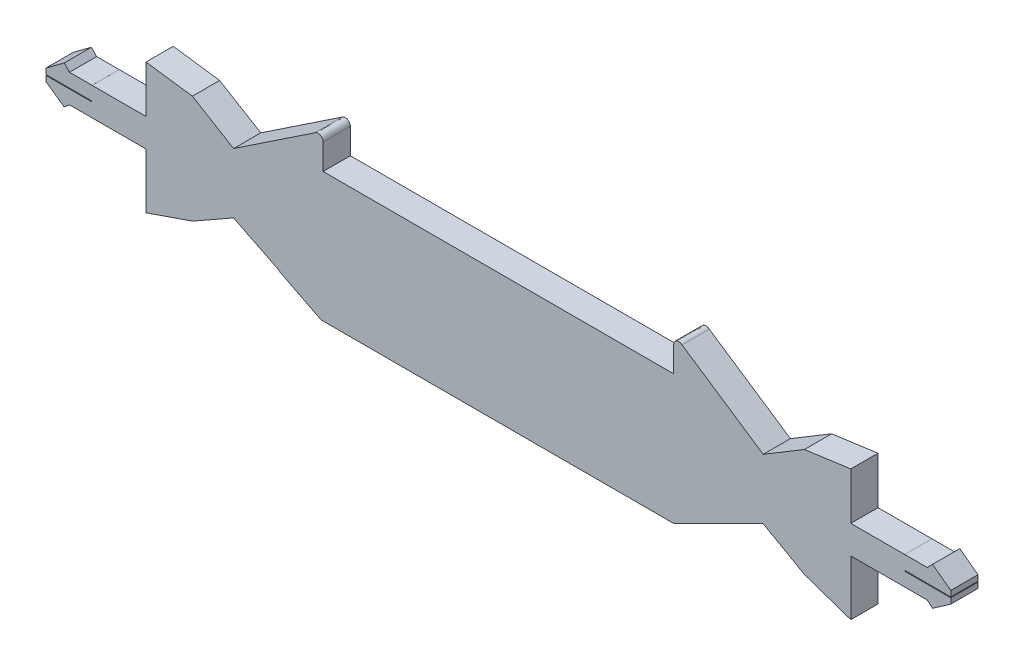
ISO-10303-21;
HEADER;
FILE_DESCRIPTION(('STEP AP214'),'2;1');
FILE_NAME('part.step','',(''),(''),'','','');
FILE_SCHEMA(('AUTOMOTIVE_DESIGN { 1 0 10303 214 1 1 1 1 }'));
ENDSEC;
DATA;
#1=APPLICATION_CONTEXT('core data for automotive mechanical design processes');
#2=APPLICATION_PROTOCOL_DEFINITION('international standard','automotive_design',2000,#1);
#3=PRODUCT_CONTEXT('',#1,'mechanical');
#4=PRODUCT('Part','Part','',(#3));
#5=PRODUCT_RELATED_PRODUCT_CATEGORY('part','',(#4));
#6=PRODUCT_DEFINITION_FORMATION('','',#4);
#7=PRODUCT_DEFINITION_CONTEXT('part definition',#1,'design');
#8=PRODUCT_DEFINITION('design','',#6,#7);
#9=PRODUCT_DEFINITION_SHAPE('','',#8);
#10=(LENGTH_UNIT() NAMED_UNIT(*) SI_UNIT(.MILLI.,.METRE.));
#11=(NAMED_UNIT(*) PLANE_ANGLE_UNIT() SI_UNIT($,.RADIAN.));
#12=(NAMED_UNIT(*) SI_UNIT($,.STERADIAN.) SOLID_ANGLE_UNIT());
#13=UNCERTAINTY_MEASURE_WITH_UNIT(LENGTH_MEASURE(1.E-05),#10,'distance_accuracy_value','');
#14=(GEOMETRIC_REPRESENTATION_CONTEXT(3) GLOBAL_UNCERTAINTY_ASSIGNED_CONTEXT((#13)) GLOBAL_UNIT_ASSIGNED_CONTEXT((#10,
#11,#12)) REPRESENTATION_CONTEXT('',''));
#15=CARTESIAN_POINT('',(0.,0.,0.));
#16=DIRECTION('',(0.,0.,1.));
#17=DIRECTION('',(1.,0.,0.));
#18=AXIS2_PLACEMENT_3D('',#15,#16,#17);
#19=CARTESIAN_POINT('',(264.822078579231,522.586033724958,3.));
#20=DIRECTION('',(-1.,0.,0.));
#21=DIRECTION('',(0.,0.,1.));
#22=AXIS2_PLACEMENT_3D('',#19,#20,#21);
#23=PLANE('',#22);
#24=DIRECTION('',(0.,1.,0.));
#25=VECTOR('',#24,1.);
#26=CARTESIAN_POINT('',(264.822078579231,522.586033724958,0.));
#27=LINE('',#26,#25);
#28=CARTESIAN_POINT('',(264.822078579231,522.586033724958,0.));
#29=VERTEX_POINT('',#28);
#30=CARTESIAN_POINT('',(264.822078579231,525.39189174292,0.));
#31=VERTEX_POINT('',#30);
#32=EDGE_CURVE('E11',#29,#31,#27,.T.);
#33=ORIENTED_EDGE('',*,*,#32,.T.);
#34=DIRECTION('',(0.,0.,-1.));
#35=VECTOR('',#34,1.);
#36=CARTESIAN_POINT('',(264.822078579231,525.39189174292,3.));
#37=LINE('',#36,#35);
#38=CARTESIAN_POINT('',(264.822078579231,525.39189174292,3.));
#39=VERTEX_POINT('',#38);
#40=EDGE_CURVE('E387',#39,#31,#37,.T.);
#41=ORIENTED_EDGE('',*,*,#40,.F.);
#42=DIRECTION('',(0.,1.,0.));
#43=VECTOR('',#42,1.);
#44=CARTESIAN_POINT('',(264.822078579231,522.586033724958,3.));
#45=LINE('',#44,#43);
#46=CARTESIAN_POINT('',(264.822078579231,522.586033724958,3.));
#47=VERTEX_POINT('',#46);
#48=EDGE_CURVE('E222',#47,#39,#45,.T.);
#49=ORIENTED_EDGE('',*,*,#48,.F.);
#50=DIRECTION('',(0.,0.,-1.));
#51=VECTOR('',#50,1.);
#52=CARTESIAN_POINT('',(264.822078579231,522.586033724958,3.));
#53=LINE('',#52,#51);
#54=EDGE_CURVE('E832',#47,#29,#53,.T.);
#55=ORIENTED_EDGE('',*,*,#54,.T.);
#56=EDGE_LOOP('',(#33,#41,#49,#55));
#57=FACE_BOUND('',#56,.T.);
#58=ADVANCED_FACE('F44',(#57),#23,.F.);
#59=CARTESIAN_POINT('',(264.822078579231,525.39189174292,3.));
#60=CARTESIAN_POINT('',(264.822078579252,525.869209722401,3.));
#61=CARTESIAN_POINT('',(264.261130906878,526.125697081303,3.));
#62=CARTESIAN_POINT('',(263.90008490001,525.813399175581,3.));
#63=B_SPLINE_CURVE_WITH_KNOTS('',3,(#59,#60,#61,#62),.UNSPECIFIED.,.F.,.F.,(4,4),(4.,5.),.UNSPECIFIED.);
#64=DIRECTION('',(0.,0.,-1.));
#65=VECTOR('',#64,1.);
#66=SURFACE_OF_LINEAR_EXTRUSION('',#63,#65);
#67=CARTESIAN_POINT('',(264.822078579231,525.39189174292,0.));
#68=CARTESIAN_POINT('',(264.822078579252,525.869209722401,0.));
#69=CARTESIAN_POINT('',(264.261130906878,526.125697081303,0.));
#70=CARTESIAN_POINT('',(263.90008490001,525.813399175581,0.));
#71=B_SPLINE_CURVE_WITH_KNOTS('',3,(#67,#68,#69,#70),.UNSPECIFIED.,.F.,.F.,(4,4),(4.,5.),.UNSPECIFIED.);
#72=CARTESIAN_POINT('',(263.90008490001,525.813399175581,0.));
#73=VERTEX_POINT('',#72);
#74=EDGE_CURVE('E57',#31,#73,#71,.T.);
#75=ORIENTED_EDGE('',*,*,#74,.T.);
#76=DIRECTION('',(0.,0.,-1.));
#77=VECTOR('',#76,1.);
#78=CARTESIAN_POINT('',(263.90008490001,525.813399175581,3.));
#79=LINE('',#78,#77);
#80=CARTESIAN_POINT('',(263.90008490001,525.813399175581,3.));
#81=VERTEX_POINT('',#80);
#82=EDGE_CURVE('E390',#81,#73,#79,.T.);
#83=ORIENTED_EDGE('',*,*,#82,.F.);
#84=EDGE_CURVE('E461',#39,#81,#63,.T.);
#85=ORIENTED_EDGE('',*,*,#84,.F.);
#86=ORIENTED_EDGE('',*,*,#40,.T.);
#87=EDGE_LOOP('',(#75,#83,#85,#86));
#88=FACE_BOUND('',#87,.T.);
#89=ADVANCED_FACE('F389',(#88),#66,.F.);
#90=CARTESIAN_POINT('',(263.90008490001,525.813399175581,3.));
#91=DIRECTION('',(0.555361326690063,-0.831609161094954,0.));
#92=DIRECTION('',(0.831609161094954,0.555361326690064,0.));
#93=AXIS2_PLACEMENT_3D('',#90,#91,#92);
#94=PLANE('',#93);
#95=DIRECTION('',(-0.831609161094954,-0.555361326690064,0.));
#96=VECTOR('',#95,1.);
#97=CARTESIAN_POINT('',(263.90008490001,525.813399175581,0.));
#98=LINE('',#97,#96);
#99=CARTESIAN_POINT('',(254.952224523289,519.837881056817,0.));
#100=VERTEX_POINT('',#99);
#101=EDGE_CURVE('E393',#73,#100,#98,.T.);
#102=ORIENTED_EDGE('',*,*,#101,.T.);
#103=DIRECTION('',(0.,0.,-1.));
#104=VECTOR('',#103,1.);
#105=CARTESIAN_POINT('',(254.952224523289,519.837881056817,3.));
#106=LINE('',#105,#104);
#107=CARTESIAN_POINT('',(254.952224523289,519.837881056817,3.));
#108=VERTEX_POINT('',#107);
#109=EDGE_CURVE('E401',#108,#100,#106,.T.);
#110=ORIENTED_EDGE('',*,*,#109,.F.);
#111=DIRECTION('',(-0.831609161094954,-0.555361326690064,0.));
#112=VECTOR('',#111,1.);
#113=CARTESIAN_POINT('',(263.90008490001,525.813399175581,3.));
#114=LINE('',#113,#112);
#115=EDGE_CURVE('E402',#81,#108,#114,.T.);
#116=ORIENTED_EDGE('',*,*,#115,.F.);
#117=ORIENTED_EDGE('',*,*,#82,.T.);
#118=EDGE_LOOP('',(#102,#110,#116,#117));
#119=FACE_BOUND('',#118,.T.);
#120=ADVANCED_FACE('F396',(#119),#94,.F.);
#121=CARTESIAN_POINT('',(254.952224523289,519.837881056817,3.));
#122=DIRECTION('',(-0.515554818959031,-0.85685659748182,0.));
#123=DIRECTION('',(0.85685659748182,-0.515554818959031,0.));
#124=AXIS2_PLACEMENT_3D('',#121,#122,#123);
#125=PLANE('',#124);
#126=DIRECTION('',(-0.856856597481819,0.515554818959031,0.));
#127=VECTOR('',#126,1.);
#128=CARTESIAN_POINT('',(254.952224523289,519.837881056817,0.));
#129=LINE('',#128,#127);
#130=CARTESIAN_POINT('',(250.414258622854,522.568291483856,0.));
#131=VERTEX_POINT('',#130);
#132=EDGE_CURVE('E410',#100,#131,#129,.T.);
#133=ORIENTED_EDGE('',*,*,#132,.T.);
#134=DIRECTION('',(0.,0.,-1.));
#135=VECTOR('',#134,1.);
#136=CARTESIAN_POINT('',(250.414258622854,522.568291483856,3.));
#137=LINE('',#136,#135);
#138=CARTESIAN_POINT('',(250.414258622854,522.568291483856,3.));
#139=VERTEX_POINT('',#138);
#140=EDGE_CURVE('E631',#139,#131,#137,.T.);
#141=ORIENTED_EDGE('',*,*,#140,.F.);
#142=DIRECTION('',(-0.856856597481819,0.515554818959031,0.));
#143=VECTOR('',#142,1.);
#144=CARTESIAN_POINT('',(254.952224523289,519.837881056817,3.));
#145=LINE('',#144,#143);
#146=EDGE_CURVE('E842',#108,#139,#145,.T.);
#147=ORIENTED_EDGE('',*,*,#146,.F.);
#148=ORIENTED_EDGE('',*,*,#109,.T.);
#149=EDGE_LOOP('',(#133,#141,#147,#148));
#150=FACE_BOUND('',#149,.T.);
#151=ADVANCED_FACE('F843',(#150),#125,.F.);
#152=CARTESIAN_POINT('',(250.414258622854,522.568291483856,3.));
#153=DIRECTION('',(-0.136599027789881,-0.990626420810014,0.));
#154=DIRECTION('',(0.990626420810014,-0.136599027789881,0.));
#155=AXIS2_PLACEMENT_3D('',#152,#153,#154);
#156=PLANE('',#155);
#157=DIRECTION('',(-0.990626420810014,0.136599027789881,0.));
#158=VECTOR('',#157,1.);
#159=CARTESIAN_POINT('',(250.414258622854,522.568291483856,0.));
#160=LINE('',#159,#158);
#161=CARTESIAN_POINT('',(245.297516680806,523.273847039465,0.));
#162=VERTEX_POINT('',#161);
#163=EDGE_CURVE('E414',#131,#162,#160,.T.);
#164=ORIENTED_EDGE('',*,*,#163,.T.);
#165=DIRECTION('',(0.,0.,-1.));
#166=VECTOR('',#165,1.);
#167=CARTESIAN_POINT('',(245.297516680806,523.273847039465,3.));
#168=LINE('',#167,#166);
#169=CARTESIAN_POINT('',(245.297516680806,523.273847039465,3.));
#170=VERTEX_POINT('',#169);
#171=EDGE_CURVE('E628',#170,#162,#168,.T.);
#172=ORIENTED_EDGE('',*,*,#171,.F.);
#173=DIRECTION('',(-0.990626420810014,0.136599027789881,0.));
#174=VECTOR('',#173,1.);
#175=CARTESIAN_POINT('',(250.414258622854,522.568291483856,3.));
#176=LINE('',#175,#174);
#177=EDGE_CURVE('E849',#139,#170,#176,.T.);
#178=ORIENTED_EDGE('',*,*,#177,.F.);
#179=ORIENTED_EDGE('',*,*,#140,.T.);
#180=EDGE_LOOP('',(#164,#172,#178,#179));
#181=FACE_BOUND('',#180,.T.);
#182=ADVANCED_FACE('F626',(#181),#156,.F.);
#183=CARTESIAN_POINT('',(245.297516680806,523.273847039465,3.));
#184=DIRECTION('',(1.,0.,0.));
#185=DIRECTION('',(0.,0.,-1.));
#186=AXIS2_PLACEMENT_3D('',#183,#184,#185);
#187=PLANE('',#186);
#188=DIRECTION('',(0.,-1.,0.));
#189=VECTOR('',#188,1.);
#190=CARTESIAN_POINT('',(245.297516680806,523.273847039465,0.));
#191=LINE('',#190,#189);
#192=CARTESIAN_POINT('',(245.297516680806,518.073992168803,0.));
#193=VERTEX_POINT('',#192);
#194=EDGE_CURVE('E620',#162,#193,#191,.T.);
#195=ORIENTED_EDGE('',*,*,#194,.T.);
#196=DIRECTION('',(0.,0.,-1.));
#197=VECTOR('',#196,1.);
#198=CARTESIAN_POINT('',(245.297516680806,518.073992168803,3.));
#199=LINE('',#198,#197);
#200=CARTESIAN_POINT('',(245.297516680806,518.073992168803,3.));
#201=VERTEX_POINT('',#200);
#202=EDGE_CURVE('E638',#201,#193,#199,.T.);
#203=ORIENTED_EDGE('',*,*,#202,.F.);
#204=DIRECTION('',(0.,-1.,0.));
#205=VECTOR('',#204,1.);
#206=CARTESIAN_POINT('',(245.297516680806,523.273847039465,3.));
#207=LINE('',#206,#205);
#208=EDGE_CURVE('E640',#170,#201,#207,.T.);
#209=ORIENTED_EDGE('',*,*,#208,.F.);
#210=ORIENTED_EDGE('',*,*,#171,.T.);
#211=EDGE_LOOP('',(#195,#203,#209,#210));
#212=FACE_BOUND('',#211,.T.);
#213=ADVANCED_FACE('F632',(#212),#187,.F.);
#214=CARTESIAN_POINT('',(245.297516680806,518.073992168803,3.));
#215=DIRECTION('',(0.,-1.,0.));
#216=DIRECTION('',(0.,0.,-1.));
#217=AXIS2_PLACEMENT_3D('',#214,#215,#216);
#218=PLANE('',#217);
#219=DIRECTION('',(-1.,0.,0.));
#220=VECTOR('',#219,1.);
#221=CARTESIAN_POINT('',(245.297516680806,518.073992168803,0.));
#222=LINE('',#221,#220);
#223=CARTESIAN_POINT('',(239.359636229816,518.073992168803,0.));
#224=VERTEX_POINT('',#223);
#225=EDGE_CURVE('E618',#193,#224,#222,.T.);
#226=ORIENTED_EDGE('',*,*,#225,.T.);
#227=DIRECTION('',(0.,0.,-1.));
#228=VECTOR('',#227,1.);
#229=CARTESIAN_POINT('',(239.359636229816,518.073992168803,3.));
#230=LINE('',#229,#228);
#231=CARTESIAN_POINT('',(239.359636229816,518.073992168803,3.));
#232=VERTEX_POINT('',#231);
#233=EDGE_CURVE('E648',#232,#224,#230,.T.);
#234=ORIENTED_EDGE('',*,*,#233,.F.);
#235=DIRECTION('',(-1.,0.,0.));
#236=VECTOR('',#235,1.);
#237=CARTESIAN_POINT('',(245.297516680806,518.073992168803,3.));
#238=LINE('',#237,#236);
#239=EDGE_CURVE('E854',#201,#232,#238,.T.);
#240=ORIENTED_EDGE('',*,*,#239,.F.);
#241=ORIENTED_EDGE('',*,*,#202,.T.);
#242=EDGE_LOOP('',(#226,#234,#240,#241));
#243=FACE_BOUND('',#242,.T.);
#244=ADVANCED_FACE('F646',(#243),#218,.F.);
#245=CARTESIAN_POINT('',(239.359636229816,518.073992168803,3.));
#246=DIRECTION('',(-1.,0.,0.));
#247=DIRECTION('',(0.,0.,1.));
#248=AXIS2_PLACEMENT_3D('',#245,#246,#247);
#249=PLANE('',#248);
#250=DIRECTION('',(0.,1.,0.));
#251=VECTOR('',#250,1.);
#252=CARTESIAN_POINT('',(239.359636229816,518.073992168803,0.));
#253=LINE('',#252,#251);
#254=CARTESIAN_POINT('',(239.359636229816,518.075370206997,0.));
#255=VERTEX_POINT('',#254);
#256=EDGE_CURVE('E611',#224,#255,#253,.T.);
#257=ORIENTED_EDGE('',*,*,#256,.T.);
#258=DIRECTION('',(0.,0.,-1.));
#259=VECTOR('',#258,1.);
#260=CARTESIAN_POINT('',(239.359636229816,518.075370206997,3.));
#261=LINE('',#260,#259);
#262=CARTESIAN_POINT('',(239.359636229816,518.075370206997,3.));
#263=VERTEX_POINT('',#262);
#264=EDGE_CURVE('E660',#263,#255,#261,.T.);
#265=ORIENTED_EDGE('',*,*,#264,.F.);
#266=DIRECTION('',(0.,1.,0.));
#267=VECTOR('',#266,1.);
#268=CARTESIAN_POINT('',(239.359636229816,518.073992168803,3.));
#269=LINE('',#268,#267);
#270=EDGE_CURVE('E653',#232,#263,#269,.T.);
#271=ORIENTED_EDGE('',*,*,#270,.F.);
#272=ORIENTED_EDGE('',*,*,#233,.T.);
#273=EDGE_LOOP('',(#257,#265,#271,#272));
#274=FACE_BOUND('',#273,.T.);
#275=ADVANCED_FACE('F654',(#274),#249,.F.);
#276=CARTESIAN_POINT('',(239.359636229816,518.075370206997,3.));
#277=DIRECTION('',(0.,-1.,0.));
#278=DIRECTION('',(0.,0.,-1.));
#279=AXIS2_PLACEMENT_3D('',#276,#277,#278);
#280=PLANE('',#279);
#281=DIRECTION('',(-1.,0.,0.));
#282=VECTOR('',#281,1.);
#283=CARTESIAN_POINT('',(239.359636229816,518.075370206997,0.));
#284=LINE('',#283,#282);
#285=CARTESIAN_POINT('',(236.861985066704,518.075370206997,0.));
#286=VERTEX_POINT('',#285);
#287=EDGE_CURVE('E608',#255,#286,#284,.T.);
#288=ORIENTED_EDGE('',*,*,#287,.T.);
#289=DIRECTION('',(0.,0.,-1.));
#290=VECTOR('',#289,1.);
#291=CARTESIAN_POINT('',(236.861985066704,518.075370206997,3.));
#292=LINE('',#291,#290);
#293=CARTESIAN_POINT('',(236.861985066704,518.075370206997,3.));
#294=VERTEX_POINT('',#293);
#295=EDGE_CURVE('E662',#294,#286,#292,.T.);
#296=ORIENTED_EDGE('',*,*,#295,.F.);
#297=DIRECTION('',(-1.,0.,0.));
#298=VECTOR('',#297,1.);
#299=CARTESIAN_POINT('',(239.359636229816,518.075370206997,3.));
#300=LINE('',#299,#298);
#301=EDGE_CURVE('E859',#263,#294,#300,.T.);
#302=ORIENTED_EDGE('',*,*,#301,.F.);
#303=ORIENTED_EDGE('',*,*,#264,.T.);
#304=EDGE_LOOP('',(#288,#296,#302,#303));
#305=FACE_BOUND('',#304,.T.);
#306=ADVANCED_FACE('F1177',(#305),#280,.F.);
#307=CARTESIAN_POINT('',(236.861985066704,518.075370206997,3.));
#308=DIRECTION('',(-0.719281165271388,-0.694719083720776,0.));
#309=DIRECTION('',(0.694719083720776,-0.719281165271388,0.));
#310=AXIS2_PLACEMENT_3D('',#307,#308,#309);
#311=PLANE('',#310);
#312=DIRECTION('',(-0.694719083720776,0.719281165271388,0.));
#313=VECTOR('',#312,1.);
#314=CARTESIAN_POINT('',(236.861985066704,518.075370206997,0.));
#315=LINE('',#314,#313);
#316=CARTESIAN_POINT('',(236.283424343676,518.67438618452,0.));
#317=VERTEX_POINT('',#316);
#318=EDGE_CURVE('E609',#286,#317,#315,.T.);
#319=ORIENTED_EDGE('',*,*,#318,.T.);
#320=DIRECTION('',(0.,0.,-1.));
#321=VECTOR('',#320,1.);
#322=CARTESIAN_POINT('',(236.283424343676,518.67438618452,3.));
#323=LINE('',#322,#321);
#324=CARTESIAN_POINT('',(236.283424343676,518.67438618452,3.));
#325=VERTEX_POINT('',#324);
#326=EDGE_CURVE('E670',#325,#317,#323,.T.);
#327=ORIENTED_EDGE('',*,*,#326,.F.);
#328=DIRECTION('',(-0.694719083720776,0.719281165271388,0.));
#329=VECTOR('',#328,1.);
#330=CARTESIAN_POINT('',(236.861985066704,518.075370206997,3.));
#331=LINE('',#330,#329);
#332=EDGE_CURVE('E861',#294,#325,#331,.T.);
#333=ORIENTED_EDGE('',*,*,#332,.F.);
#334=ORIENTED_EDGE('',*,*,#295,.T.);
#335=EDGE_LOOP('',(#319,#327,#333,#334));
#336=FACE_BOUND('',#335,.T.);
#337=ADVANCED_FACE('F1180',(#336),#311,.F.);
#338=CARTESIAN_POINT('',(236.283424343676,518.67438618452,3.));
#339=DIRECTION('',(0.596056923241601,-0.802942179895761,0.));
#340=DIRECTION('',(0.802942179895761,0.596056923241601,0.));
#341=AXIS2_PLACEMENT_3D('',#338,#339,#340);
#342=PLANE('',#341);
#343=DIRECTION('',(-0.802942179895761,-0.596056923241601,0.));
#344=VECTOR('',#343,1.);
#345=CARTESIAN_POINT('',(236.283424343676,518.67438618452,0.));
#346=LINE('',#345,#344);
#347=CARTESIAN_POINT('',(234.276139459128,517.184296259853,0.));
#348=VERTEX_POINT('',#347);
#349=EDGE_CURVE('E603',#317,#348,#346,.T.);
#350=ORIENTED_EDGE('',*,*,#349,.T.);
#351=DIRECTION('',(0.,0.,-1.));
#352=VECTOR('',#351,1.);
#353=CARTESIAN_POINT('',(234.276139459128,517.184296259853,3.));
#354=LINE('',#353,#352);
#355=CARTESIAN_POINT('',(234.276139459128,517.184296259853,3.));
#356=VERTEX_POINT('',#355);
#357=EDGE_CURVE('E674',#356,#348,#354,.T.);
#358=ORIENTED_EDGE('',*,*,#357,.F.);
#359=DIRECTION('',(-0.802942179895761,-0.596056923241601,0.));
#360=VECTOR('',#359,1.);
#361=CARTESIAN_POINT('',(236.283424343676,518.67438618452,3.));
#362=LINE('',#361,#360);
#363=EDGE_CURVE('E862',#325,#356,#362,.T.);
#364=ORIENTED_EDGE('',*,*,#363,.F.);
#365=ORIENTED_EDGE('',*,*,#326,.T.);
#366=EDGE_LOOP('',(#350,#358,#364,#365));
#367=FACE_BOUND('',#366,.T.);
#368=ADVANCED_FACE('F1175',(#367),#342,.F.);
#369=CARTESIAN_POINT('',(234.276139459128,517.184296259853,3.));
#370=DIRECTION('',(1.,0.,0.));
#371=DIRECTION('',(0.,0.,-1.));
#372=AXIS2_PLACEMENT_3D('',#369,#370,#371);
#373=PLANE('',#372);
#374=DIRECTION('',(0.,-1.,0.));
#375=VECTOR('',#374,1.);
#376=CARTESIAN_POINT('',(234.276139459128,517.184296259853,0.));
#377=LINE('',#376,#375);
#378=CARTESIAN_POINT('',(234.276139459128,516.563317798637,0.));
#379=VERTEX_POINT('',#378);
#380=EDGE_CURVE('E604',#348,#379,#377,.T.);
#381=ORIENTED_EDGE('',*,*,#380,.T.);
#382=DIRECTION('',(0.,0.,-1.));
#383=VECTOR('',#382,1.);
#384=CARTESIAN_POINT('',(234.276139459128,516.563317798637,3.));
#385=LINE('',#384,#383);
#386=CARTESIAN_POINT('',(234.276139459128,516.563317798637,3.));
#387=VERTEX_POINT('',#386);
#388=EDGE_CURVE('E678',#387,#379,#385,.T.);
#389=ORIENTED_EDGE('',*,*,#388,.F.);
#390=DIRECTION('',(0.,-1.,0.));
#391=VECTOR('',#390,1.);
#392=CARTESIAN_POINT('',(234.276139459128,517.184296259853,3.));
#393=LINE('',#392,#391);
#394=EDGE_CURVE('E870',#356,#387,#393,.T.);
#395=ORIENTED_EDGE('',*,*,#394,.F.);
#396=ORIENTED_EDGE('',*,*,#357,.T.);
#397=EDGE_LOOP('',(#381,#389,#395,#396));
#398=FACE_BOUND('',#397,.T.);
#399=ADVANCED_FACE('F1170',(#398),#373,.F.);
#400=CARTESIAN_POINT('',(234.276139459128,516.563317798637,3.));
#401=DIRECTION('',(0.,1.,0.));
#402=DIRECTION('',(0.,0.,1.));
#403=AXIS2_PLACEMENT_3D('',#400,#401,#402);
#404=PLANE('',#403);
#405=DIRECTION('',(1.,0.,0.));
#406=VECTOR('',#405,1.);
#407=CARTESIAN_POINT('',(234.276139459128,516.563317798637,0.));
#408=LINE('',#407,#406);
#409=CARTESIAN_POINT('',(239.297538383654,516.563317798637,0.));
#410=VERTEX_POINT('',#409);
#411=EDGE_CURVE('E596',#379,#410,#408,.T.);
#412=ORIENTED_EDGE('',*,*,#411,.T.);
#413=DIRECTION('',(0.,0.,-1.));
#414=VECTOR('',#413,1.);
#415=CARTESIAN_POINT('',(239.297538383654,516.563317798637,3.));
#416=LINE('',#415,#414);
#417=CARTESIAN_POINT('',(239.297538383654,516.563317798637,3.));
#418=VERTEX_POINT('',#417);
#419=EDGE_CURVE('E677',#418,#410,#416,.T.);
#420=ORIENTED_EDGE('',*,*,#419,.F.);
#421=DIRECTION('',(1.,0.,0.));
#422=VECTOR('',#421,1.);
#423=CARTESIAN_POINT('',(234.276139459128,516.563317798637,3.));
#424=LINE('',#423,#422);
#425=EDGE_CURVE('E873',#387,#418,#424,.T.);
#426=ORIENTED_EDGE('',*,*,#425,.F.);
#427=ORIENTED_EDGE('',*,*,#388,.T.);
#428=EDGE_LOOP('',(#412,#420,#426,#427));
#429=FACE_BOUND('',#428,.T.);
#430=ADVANCED_FACE('F1165',(#429),#404,.F.);
#431=CARTESIAN_POINT('',(239.297538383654,516.563317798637,3.));
#432=DIRECTION('',(1.,0.,0.));
#433=DIRECTION('',(0.,0.,-1.));
#434=AXIS2_PLACEMENT_3D('',#431,#432,#433);
#435=PLANE('',#434);
#436=DIRECTION('',(0.,-1.,0.));
#437=VECTOR('',#436,1.);
#438=CARTESIAN_POINT('',(239.297538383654,516.563317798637,0.));
#439=LINE('',#438,#437);
#440=CARTESIAN_POINT('',(239.297538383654,516.479429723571,0.));
#441=VERTEX_POINT('',#440);
#442=EDGE_CURVE('E592',#410,#441,#439,.T.);
#443=ORIENTED_EDGE('',*,*,#442,.T.);
#444=DIRECTION('',(0.,0.,-1.));
#445=VECTOR('',#444,1.);
#446=CARTESIAN_POINT('',(239.297538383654,516.479429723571,3.));
#447=LINE('',#446,#445);
#448=CARTESIAN_POINT('',(239.297538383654,516.479429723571,3.));
#449=VERTEX_POINT('',#448);
#450=EDGE_CURVE('E685',#449,#441,#447,.T.);
#451=ORIENTED_EDGE('',*,*,#450,.F.);
#452=DIRECTION('',(0.,-1.,0.));
#453=VECTOR('',#452,1.);
#454=CARTESIAN_POINT('',(239.297538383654,516.563317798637,3.));
#455=LINE('',#454,#453);
#456=EDGE_CURVE('E874',#418,#449,#455,.T.);
#457=ORIENTED_EDGE('',*,*,#456,.F.);
#458=ORIENTED_EDGE('',*,*,#419,.T.);
#459=EDGE_LOOP('',(#443,#451,#457,#458));
#460=FACE_BOUND('',#459,.T.);
#461=ADVANCED_FACE('F1157',(#460),#435,.F.);
#462=CARTESIAN_POINT('',(239.297538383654,516.479429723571,3.));
#463=DIRECTION('',(0.,-1.,0.));
#464=DIRECTION('',(0.,0.,-1.));
#465=AXIS2_PLACEMENT_3D('',#462,#463,#464);
#466=PLANE('',#465);
#467=DIRECTION('',(-1.,0.,0.));
#468=VECTOR('',#467,1.);
#469=CARTESIAN_POINT('',(239.297538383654,516.479429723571,0.));
#470=LINE('',#469,#468);
#471=CARTESIAN_POINT('',(234.276139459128,516.479429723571,0.));
#472=VERTEX_POINT('',#471);
#473=EDGE_CURVE('E595',#441,#472,#470,.T.);
#474=ORIENTED_EDGE('',*,*,#473,.T.);
#475=DIRECTION('',(0.,0.,-1.));
#476=VECTOR('',#475,1.);
#477=CARTESIAN_POINT('',(234.276139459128,516.479429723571,3.));
#478=LINE('',#477,#476);
#479=CARTESIAN_POINT('',(234.276139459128,516.479429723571,3.));
#480=VERTEX_POINT('',#479);
#481=EDGE_CURVE('E686',#480,#472,#478,.T.);
#482=ORIENTED_EDGE('',*,*,#481,.F.);
#483=DIRECTION('',(-1.,0.,0.));
#484=VECTOR('',#483,1.);
#485=CARTESIAN_POINT('',(239.297538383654,516.479429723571,3.));
#486=LINE('',#485,#484);
#487=EDGE_CURVE('E877',#449,#480,#486,.T.);
#488=ORIENTED_EDGE('',*,*,#487,.F.);
#489=ORIENTED_EDGE('',*,*,#450,.T.);
#490=EDGE_LOOP('',(#474,#482,#488,#489));
#491=FACE_BOUND('',#490,.T.);
#492=ADVANCED_FACE('F1153',(#491),#466,.F.);
#493=CARTESIAN_POINT('',(234.276139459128,516.479429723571,3.));
#494=DIRECTION('',(1.,0.,0.));
#495=DIRECTION('',(0.,0.,-1.));
#496=AXIS2_PLACEMENT_3D('',#493,#494,#495);
#497=PLANE('',#496);
#498=DIRECTION('',(0.,-1.,0.));
#499=VECTOR('',#498,1.);
#500=CARTESIAN_POINT('',(234.276139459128,516.479429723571,0.));
#501=LINE('',#500,#499);
#502=CARTESIAN_POINT('',(234.276139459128,515.873092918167,0.));
#503=VERTEX_POINT('',#502);
#504=EDGE_CURVE('E586',#472,#503,#501,.T.);
#505=ORIENTED_EDGE('',*,*,#504,.T.);
#506=DIRECTION('',(0.,0.,-1.));
#507=VECTOR('',#506,1.);
#508=CARTESIAN_POINT('',(234.276139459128,515.873092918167,3.));
#509=LINE('',#508,#507);
#510=CARTESIAN_POINT('',(234.276139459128,515.873092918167,3.));
#511=VERTEX_POINT('',#510);
#512=EDGE_CURVE('E695',#511,#503,#509,.T.);
#513=ORIENTED_EDGE('',*,*,#512,.F.);
#514=DIRECTION('',(0.,-1.,0.));
#515=VECTOR('',#514,1.);
#516=CARTESIAN_POINT('',(234.276139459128,516.479429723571,3.));
#517=LINE('',#516,#515);
#518=EDGE_CURVE('E879',#480,#511,#517,.T.);
#519=ORIENTED_EDGE('',*,*,#518,.F.);
#520=ORIENTED_EDGE('',*,*,#481,.T.);
#521=EDGE_LOOP('',(#505,#513,#519,#520));
#522=FACE_BOUND('',#521,.T.);
#523=ADVANCED_FACE('F1150',(#522),#497,.F.);
#524=CARTESIAN_POINT('',(234.276139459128,515.873092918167,3.));
#525=DIRECTION('',(0.571731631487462,0.820440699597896,0.));
#526=DIRECTION('',(-0.820440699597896,0.571731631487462,0.));
#527=AXIS2_PLACEMENT_3D('',#524,#525,#526);
#528=PLANE('',#527);
#529=DIRECTION('',(0.820440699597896,-0.571731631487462,0.));
#530=VECTOR('',#529,1.);
#531=CARTESIAN_POINT('',(234.276139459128,515.873092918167,0.));
#532=LINE('',#531,#530);
#533=CARTESIAN_POINT('',(236.283424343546,514.474298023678,0.));
#534=VERTEX_POINT('',#533);
#535=EDGE_CURVE('E587',#503,#534,#532,.T.);
#536=ORIENTED_EDGE('',*,*,#535,.T.);
#537=DIRECTION('',(0.,0.,-1.));
#538=VECTOR('',#537,1.);
#539=CARTESIAN_POINT('',(236.283424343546,514.474298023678,3.));
#540=LINE('',#539,#538);
#541=CARTESIAN_POINT('',(236.283424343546,514.474298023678,3.));
#542=VERTEX_POINT('',#541);
#543=EDGE_CURVE('E696',#542,#534,#540,.T.);
#544=ORIENTED_EDGE('',*,*,#543,.F.);
#545=DIRECTION('',(0.820440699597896,-0.571731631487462,0.));
#546=VECTOR('',#545,1.);
#547=CARTESIAN_POINT('',(234.276139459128,515.873092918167,3.));
#548=LINE('',#547,#546);
#549=EDGE_CURVE('E881',#511,#542,#548,.T.);
#550=ORIENTED_EDGE('',*,*,#549,.F.);
#551=ORIENTED_EDGE('',*,*,#512,.T.);
#552=EDGE_LOOP('',(#536,#544,#550,#551));
#553=FACE_BOUND('',#552,.T.);
#554=ADVANCED_FACE('F1141',(#553),#528,.F.);
#555=CARTESIAN_POINT('',(236.283424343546,514.474298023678,3.));
#556=DIRECTION('',(-0.64864273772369,0.76109302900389,0.));
#557=DIRECTION('',(-0.76109302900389,-0.64864273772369,0.));
#558=AXIS2_PLACEMENT_3D('',#555,#556,#557);
#559=PLANE('',#558);
#560=DIRECTION('',(0.76109302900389,0.64864273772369,0.));
#561=VECTOR('',#560,1.);
#562=CARTESIAN_POINT('',(236.283424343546,514.474298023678,0.));
#563=LINE('',#562,#561);
#564=CARTESIAN_POINT('',(236.861985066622,514.967377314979,0.));
#565=VERTEX_POINT('',#564);
#566=EDGE_CURVE('E585',#534,#565,#563,.T.);
#567=ORIENTED_EDGE('',*,*,#566,.T.);
#568=DIRECTION('',(0.,0.,-1.));
#569=VECTOR('',#568,1.);
#570=CARTESIAN_POINT('',(236.861985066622,514.967377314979,3.));
#571=LINE('',#570,#569);
#572=CARTESIAN_POINT('',(236.861985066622,514.967377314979,3.));
#573=VERTEX_POINT('',#572);
#574=EDGE_CURVE('E699',#573,#565,#571,.T.);
#575=ORIENTED_EDGE('',*,*,#574,.F.);
#576=DIRECTION('',(0.76109302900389,0.64864273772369,0.));
#577=VECTOR('',#576,1.);
#578=CARTESIAN_POINT('',(236.283424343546,514.474298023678,3.));
#579=LINE('',#578,#577);
#580=EDGE_CURVE('E886',#542,#573,#579,.T.);
#581=ORIENTED_EDGE('',*,*,#580,.F.);
#582=ORIENTED_EDGE('',*,*,#543,.T.);
#583=EDGE_LOOP('',(#567,#575,#581,#582));
#584=FACE_BOUND('',#583,.T.);
#585=ADVANCED_FACE('F1136',(#584),#559,.F.);
#586=CARTESIAN_POINT('',(236.861985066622,514.967377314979,3.));
#587=DIRECTION('',(0.,1.,0.));
#588=DIRECTION('',(0.,0.,1.));
#589=AXIS2_PLACEMENT_3D('',#586,#587,#588);
#590=PLANE('',#589);
#591=DIRECTION('',(1.,0.,0.));
#592=VECTOR('',#591,1.);
#593=CARTESIAN_POINT('',(236.861985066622,514.967377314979,0.));
#594=LINE('',#593,#592);
#595=CARTESIAN_POINT('',(245.297516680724,514.967377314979,0.));
#596=VERTEX_POINT('',#595);
#597=EDGE_CURVE('E578',#565,#596,#594,.T.);
#598=ORIENTED_EDGE('',*,*,#597,.T.);
#599=DIRECTION('',(0.,0.,-1.));
#600=VECTOR('',#599,1.);
#601=CARTESIAN_POINT('',(245.297516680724,514.967377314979,3.));
#602=LINE('',#601,#600);
#603=CARTESIAN_POINT('',(245.297516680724,514.967377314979,3.));
#604=VERTEX_POINT('',#603);
#605=EDGE_CURVE('E703',#604,#596,#602,.T.);
#606=ORIENTED_EDGE('',*,*,#605,.F.);
#607=DIRECTION('',(1.,0.,0.));
#608=VECTOR('',#607,1.);
#609=CARTESIAN_POINT('',(236.861985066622,514.967377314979,3.));
#610=LINE('',#609,#608);
#611=EDGE_CURVE('E887',#573,#604,#610,.T.);
#612=ORIENTED_EDGE('',*,*,#611,.F.);
#613=ORIENTED_EDGE('',*,*,#574,.T.);
#614=EDGE_LOOP('',(#598,#606,#612,#613));
#615=FACE_BOUND('',#614,.T.);
#616=ADVANCED_FACE('F1135',(#615),#590,.F.);
#617=CARTESIAN_POINT('',(245.297516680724,514.967377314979,3.));
#618=DIRECTION('',(1.,0.,0.));
#619=DIRECTION('',(0.,0.,-1.));
#620=AXIS2_PLACEMENT_3D('',#617,#618,#619);
#621=PLANE('',#620);
#622=DIRECTION('',(0.,-1.,0.));
#623=VECTOR('',#622,1.);
#624=CARTESIAN_POINT('',(245.297516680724,514.967377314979,0.));
#625=LINE('',#624,#623);
#626=CARTESIAN_POINT('',(245.297516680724,508.876276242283,0.));
#627=VERTEX_POINT('',#626);
#628=EDGE_CURVE('E580',#596,#627,#625,.T.);
#629=ORIENTED_EDGE('',*,*,#628,.T.);
#630=DIRECTION('',(0.,0.,-1.));
#631=VECTOR('',#630,1.);
#632=CARTESIAN_POINT('',(245.297516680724,508.876276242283,3.));
#633=LINE('',#632,#631);
#634=CARTESIAN_POINT('',(245.297516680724,508.876276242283,3.));
#635=VERTEX_POINT('',#634);
#636=EDGE_CURVE('E709',#635,#627,#633,.T.);
#637=ORIENTED_EDGE('',*,*,#636,.F.);
#638=DIRECTION('',(0.,-1.,0.));
#639=VECTOR('',#638,1.);
#640=CARTESIAN_POINT('',(245.297516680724,514.967377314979,3.));
#641=LINE('',#640,#639);
#642=EDGE_CURVE('E895',#604,#635,#641,.T.);
#643=ORIENTED_EDGE('',*,*,#642,.F.);
#644=ORIENTED_EDGE('',*,*,#605,.T.);
#645=EDGE_LOOP('',(#629,#637,#643,#644));
#646=FACE_BOUND('',#645,.T.);
#647=ADVANCED_FACE('F1130',(#646),#621,.F.);
#648=CARTESIAN_POINT('',(245.297516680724,508.876276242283,3.));
#649=DIRECTION('',(-0.325907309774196,0.945401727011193,0.));
#650=DIRECTION('',(-0.945401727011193,-0.325907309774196,0.));
#651=AXIS2_PLACEMENT_3D('',#648,#649,#650);
#652=PLANE('',#651);
#653=DIRECTION('',(0.945401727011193,0.325907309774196,0.));
#654=VECTOR('',#653,1.);
#655=CARTESIAN_POINT('',(245.297516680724,508.876276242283,0.));
#656=LINE('',#655,#654);
#657=CARTESIAN_POINT('',(250.414258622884,510.640165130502,0.));
#658=VERTEX_POINT('',#657);
#659=EDGE_CURVE('E573',#627,#658,#656,.T.);
#660=ORIENTED_EDGE('',*,*,#659,.T.);
#661=DIRECTION('',(0.,0.,-1.));
#662=VECTOR('',#661,1.);
#663=CARTESIAN_POINT('',(250.414258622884,510.640165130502,3.));
#664=LINE('',#663,#662);
#665=CARTESIAN_POINT('',(250.414258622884,510.640165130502,3.));
#666=VERTEX_POINT('',#665);
#667=EDGE_CURVE('E711',#666,#658,#664,.T.);
#668=ORIENTED_EDGE('',*,*,#667,.F.);
#669=DIRECTION('',(0.945401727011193,0.325907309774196,0.));
#670=VECTOR('',#669,1.);
#671=CARTESIAN_POINT('',(245.297516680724,508.876276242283,3.));
#672=LINE('',#671,#670);
#673=EDGE_CURVE('E894',#635,#666,#672,.T.);
#674=ORIENTED_EDGE('',*,*,#673,.F.);
#675=ORIENTED_EDGE('',*,*,#636,.T.);
#676=EDGE_LOOP('',(#660,#668,#674,#675));
#677=FACE_BOUND('',#676,.T.);
#678=ADVANCED_FACE('F1125',(#677),#652,.F.);
#679=CARTESIAN_POINT('',(250.414258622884,510.640165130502,3.));
#680=DIRECTION('',(-0.493248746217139,0.869888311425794,0.));
#681=DIRECTION('',(-0.869888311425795,-0.49324874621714,0.));
#682=AXIS2_PLACEMENT_3D('',#679,#680,#681);
#683=PLANE('',#682);
#684=DIRECTION('',(0.869888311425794,0.49324874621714,0.));
#685=VECTOR('',#684,1.);
#686=CARTESIAN_POINT('',(250.414258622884,510.640165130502,0.));
#687=LINE('',#686,#685);
#688=CARTESIAN_POINT('',(254.952224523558,513.213306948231,0.));
#689=VERTEX_POINT('',#688);
#690=EDGE_CURVE('E571',#658,#689,#687,.T.);
#691=ORIENTED_EDGE('',*,*,#690,.T.);
#692=DIRECTION('',(0.,0.,-1.));
#693=VECTOR('',#692,1.);
#694=CARTESIAN_POINT('',(254.952224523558,513.213306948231,3.));
#695=LINE('',#694,#693);
#696=CARTESIAN_POINT('',(254.952224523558,513.213306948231,3.));
#697=VERTEX_POINT('',#696);
#698=EDGE_CURVE('E717',#697,#689,#695,.T.);
#699=ORIENTED_EDGE('',*,*,#698,.F.);
#700=DIRECTION('',(0.869888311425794,0.49324874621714,0.));
#701=VECTOR('',#700,1.);
#702=CARTESIAN_POINT('',(250.414258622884,510.640165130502,3.));
#703=LINE('',#702,#701);
#704=EDGE_CURVE('E897',#666,#697,#703,.T.);
#705=ORIENTED_EDGE('',*,*,#704,.F.);
#706=ORIENTED_EDGE('',*,*,#667,.T.);
#707=EDGE_LOOP('',(#691,#699,#705,#706));
#708=FACE_BOUND('',#707,.T.);
#709=ADVANCED_FACE('F1120',(#708),#683,.F.);
#710=CARTESIAN_POINT('',(254.952224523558,513.213306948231,3.));
#711=DIRECTION('',(0.445357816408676,0.895352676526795,0.));
#712=DIRECTION('',(-0.895352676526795,0.445357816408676,0.));
#713=AXIS2_PLACEMENT_3D('',#710,#711,#712);
#714=PLANE('',#713);
#715=DIRECTION('',(0.895352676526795,-0.445357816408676,0.));
#716=VECTOR('',#715,1.);
#717=CARTESIAN_POINT('',(254.952224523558,513.213306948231,0.));
#718=LINE('',#717,#716);
#719=CARTESIAN_POINT('',(259.924616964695,510.739986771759,0.));
#720=VERTEX_POINT('',#719);
#721=EDGE_CURVE('E568',#689,#720,#718,.T.);
#722=ORIENTED_EDGE('',*,*,#721,.T.);
#723=DIRECTION('',(0.,0.,-1.));
#724=VECTOR('',#723,1.);
#725=CARTESIAN_POINT('',(259.924616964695,510.739986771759,3.));
#726=LINE('',#725,#724);
#727=CARTESIAN_POINT('',(259.924616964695,510.739986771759,3.));
#728=VERTEX_POINT('',#727);
#729=EDGE_CURVE('E718',#728,#720,#726,.T.);
#730=ORIENTED_EDGE('',*,*,#729,.F.);
#731=DIRECTION('',(0.895352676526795,-0.445357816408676,0.));
#732=VECTOR('',#731,1.);
#733=CARTESIAN_POINT('',(254.952224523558,513.213306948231,3.));
#734=LINE('',#733,#732);
#735=EDGE_CURVE('E902',#697,#728,#734,.T.);
#736=ORIENTED_EDGE('',*,*,#735,.F.);
#737=ORIENTED_EDGE('',*,*,#698,.T.);
#738=EDGE_LOOP('',(#722,#730,#736,#737));
#739=FACE_BOUND('',#738,.T.);
#740=ADVANCED_FACE('F1111',(#739),#714,.F.);
#741=CARTESIAN_POINT('',(259.924616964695,510.739986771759,3.));
#742=DIRECTION('',(0.678544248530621,0.734559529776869,0.));
#743=DIRECTION('',(-0.734559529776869,0.678544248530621,0.));
#744=AXIS2_PLACEMENT_3D('',#741,#742,#743);
#745=PLANE('',#744);
#746=DIRECTION('',(0.734559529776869,-0.678544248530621,0.));
#747=VECTOR('',#746,1.);
#748=CARTESIAN_POINT('',(259.924616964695,510.739986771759,0.));
#749=LINE('',#748,#747);
#750=CARTESIAN_POINT('',(260.094588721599,510.582976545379,0.));
#751=VERTEX_POINT('',#750);
#752=EDGE_CURVE('E564',#720,#751,#749,.T.);
#753=ORIENTED_EDGE('',*,*,#752,.T.);
#754=DIRECTION('',(0.,0.,-1.));
#755=VECTOR('',#754,1.);
#756=CARTESIAN_POINT('',(260.094588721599,510.582976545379,3.));
#757=LINE('',#756,#755);
#758=CARTESIAN_POINT('',(260.094588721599,510.582976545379,3.));
#759=VERTEX_POINT('',#758);
#760=EDGE_CURVE('E724',#759,#751,#757,.T.);
#761=ORIENTED_EDGE('',*,*,#760,.F.);
#762=DIRECTION('',(0.734559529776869,-0.678544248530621,0.));
#763=VECTOR('',#762,1.);
#764=CARTESIAN_POINT('',(259.924616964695,510.739986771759,3.));
#765=LINE('',#764,#763);
#766=EDGE_CURVE('E901',#728,#759,#765,.T.);
#767=ORIENTED_EDGE('',*,*,#766,.F.);
#768=ORIENTED_EDGE('',*,*,#729,.T.);
#769=EDGE_LOOP('',(#753,#761,#767,#768));
#770=FACE_BOUND('',#769,.T.);
#771=ADVANCED_FACE('F1110',(#770),#745,.F.);
#772=CARTESIAN_POINT('',(260.094588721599,510.582976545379,3.));
#773=DIRECTION('',(0.452482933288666,0.891773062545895,0.));
#774=DIRECTION('',(-0.891773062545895,0.452482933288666,0.));
#775=AXIS2_PLACEMENT_3D('',#772,#773,#774);
#776=PLANE('',#775);
#777=DIRECTION('',(0.891773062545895,-0.452482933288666,0.));
#778=VECTOR('',#777,1.);
#779=CARTESIAN_POINT('',(260.094588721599,510.582976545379,0.));
#780=LINE('',#779,#778);
#781=CARTESIAN_POINT('',(264.586174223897,508.303959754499,0.));
#782=VERTEX_POINT('',#781);
#783=EDGE_CURVE('E565',#751,#782,#780,.T.);
#784=ORIENTED_EDGE('',*,*,#783,.T.);
#785=DIRECTION('',(0.,0.,-1.));
#786=VECTOR('',#785,1.);
#787=CARTESIAN_POINT('',(264.586174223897,508.303959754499,3.));
#788=LINE('',#787,#786);
#789=CARTESIAN_POINT('',(264.586174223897,508.303959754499,3.));
#790=VERTEX_POINT('',#789);
#791=EDGE_CURVE('E726',#790,#782,#788,.T.);
#792=ORIENTED_EDGE('',*,*,#791,.F.);
#793=DIRECTION('',(0.891773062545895,-0.452482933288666,0.));
#794=VECTOR('',#793,1.);
#795=CARTESIAN_POINT('',(260.094588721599,510.582976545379,3.));
#796=LINE('',#795,#794);
#797=EDGE_CURVE('E906',#759,#790,#796,.T.);
#798=ORIENTED_EDGE('',*,*,#797,.F.);
#799=ORIENTED_EDGE('',*,*,#760,.T.);
#800=EDGE_LOOP('',(#784,#792,#798,#799));
#801=FACE_BOUND('',#800,.T.);
#802=ADVANCED_FACE('F1101',(#801),#776,.F.);
#803=CARTESIAN_POINT('',(264.586174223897,508.303959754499,3.));
#804=DIRECTION('',(0.,1.,0.));
#805=DIRECTION('',(0.,0.,1.));
#806=AXIS2_PLACEMENT_3D('',#803,#804,#805);
#807=PLANE('',#806);
#808=DIRECTION('',(1.,0.,0.));
#809=VECTOR('',#808,1.);
#810=CARTESIAN_POINT('',(264.586174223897,508.303959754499,0.));
#811=LINE('',#810,#809);
#812=CARTESIAN_POINT('',(303.461148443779,508.303959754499,0.));
#813=VERTEX_POINT('',#812);
#814=EDGE_CURVE('E559',#782,#813,#811,.T.);
#815=ORIENTED_EDGE('',*,*,#814,.T.);
#816=DIRECTION('',(0.,0.,-1.));
#817=VECTOR('',#816,1.);
#818=CARTESIAN_POINT('',(303.461148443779,508.303959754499,3.));
#819=LINE('',#818,#817);
#820=CARTESIAN_POINT('',(303.461148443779,508.303959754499,3.));
#821=VERTEX_POINT('',#820);
#822=EDGE_CURVE('E731',#821,#813,#819,.T.);
#823=ORIENTED_EDGE('',*,*,#822,.F.);
#824=DIRECTION('',(1.,0.,0.));
#825=VECTOR('',#824,1.);
#826=CARTESIAN_POINT('',(264.586174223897,508.303959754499,3.));
#827=LINE('',#826,#825);
#828=EDGE_CURVE('E907',#790,#821,#827,.T.);
#829=ORIENTED_EDGE('',*,*,#828,.F.);
#830=ORIENTED_EDGE('',*,*,#791,.T.);
#831=EDGE_LOOP('',(#815,#823,#829,#830));
#832=FACE_BOUND('',#831,.T.);
#833=ADVANCED_FACE('F1099',(#832),#807,.F.);
#834=CARTESIAN_POINT('',(303.461148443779,508.303959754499,3.));
#835=DIRECTION('',(-0.445347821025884,0.895357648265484,0.));
#836=DIRECTION('',(-0.895357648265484,-0.445347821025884,0.));
#837=AXIS2_PLACEMENT_3D('',#834,#835,#836);
#838=PLANE('',#837);
#839=DIRECTION('',(0.895357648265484,0.445347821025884,0.));
#840=VECTOR('',#839,1.);
#841=CARTESIAN_POINT('',(303.461148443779,508.303959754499,0.));
#842=LINE('',#841,#840);
#843=CARTESIAN_POINT('',(308.043039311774,510.582976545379,0.));
#844=VERTEX_POINT('',#843);
#845=EDGE_CURVE('E558',#813,#844,#842,.T.);
#846=ORIENTED_EDGE('',*,*,#845,.T.);
#847=DIRECTION('',(0.,0.,-1.));
#848=VECTOR('',#847,1.);
#849=CARTESIAN_POINT('',(308.043039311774,510.582976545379,3.));
#850=LINE('',#849,#848);
#851=CARTESIAN_POINT('',(308.043039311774,510.582976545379,3.));
#852=VERTEX_POINT('',#851);
#853=EDGE_CURVE('E737',#852,#844,#850,.T.);
#854=ORIENTED_EDGE('',*,*,#853,.F.);
#855=DIRECTION('',(0.895357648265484,0.445347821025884,0.));
#856=VECTOR('',#855,1.);
#857=CARTESIAN_POINT('',(303.461148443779,508.303959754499,3.));
#858=LINE('',#857,#856);
#859=EDGE_CURVE('E915',#821,#852,#858,.T.);
#860=ORIENTED_EDGE('',*,*,#859,.F.);
#861=ORIENTED_EDGE('',*,*,#822,.T.);
#862=EDGE_LOOP('',(#846,#854,#860,#861));
#863=FACE_BOUND('',#862,.T.);
#864=ADVANCED_FACE('F1092',(#863),#838,.F.);
#865=CARTESIAN_POINT('',(308.043039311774,510.582976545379,3.));
#866=DIRECTION('',(-0.445453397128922,0.895305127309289,0.));
#867=DIRECTION('',(-0.895305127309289,-0.445453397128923,0.));
#868=AXIS2_PLACEMENT_3D('',#865,#866,#867);
#869=PLANE('',#868);
#870=DIRECTION('',(0.895305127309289,0.445453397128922,0.));
#871=VECTOR('',#870,1.);
#872=CARTESIAN_POINT('',(308.043039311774,510.582976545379,0.));
#873=LINE('',#872,#871);
#874=CARTESIAN_POINT('',(308.358610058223,510.739986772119,0.));
#875=VERTEX_POINT('',#874);
#876=EDGE_CURVE('E551',#844,#875,#873,.T.);
#877=ORIENTED_EDGE('',*,*,#876,.T.);
#878=DIRECTION('',(0.,0.,-1.));
#879=VECTOR('',#878,1.);
#880=CARTESIAN_POINT('',(308.358610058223,510.739986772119,3.));
#881=LINE('',#880,#879);
#882=CARTESIAN_POINT('',(308.358610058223,510.739986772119,3.));
#883=VERTEX_POINT('',#882);
#884=EDGE_CURVE('E738',#883,#875,#881,.T.);
#885=ORIENTED_EDGE('',*,*,#884,.F.);
#886=DIRECTION('',(0.895305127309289,0.445453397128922,0.));
#887=VECTOR('',#886,1.);
#888=CARTESIAN_POINT('',(308.043039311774,510.582976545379,3.));
#889=LINE('',#888,#887);
#890=EDGE_CURVE('E918',#852,#883,#889,.T.);
#891=ORIENTED_EDGE('',*,*,#890,.F.);
#892=ORIENTED_EDGE('',*,*,#853,.T.);
#893=EDGE_LOOP('',(#877,#885,#891,#892));
#894=FACE_BOUND('',#893,.T.);
#895=ADVANCED_FACE('F1090',(#894),#869,.F.);
#896=CARTESIAN_POINT('',(308.358610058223,510.739986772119,3.));
#897=DIRECTION('',(-0.445357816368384,0.895352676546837,0.));
#898=DIRECTION('',(-0.895352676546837,-0.445357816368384,0.));
#899=AXIS2_PLACEMENT_3D('',#896,#897,#898);
#900=PLANE('',#899);
#901=DIRECTION('',(0.895352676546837,0.445357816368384,0.));
#902=VECTOR('',#901,1.);
#903=CARTESIAN_POINT('',(308.358610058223,510.739986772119,0.));
#904=LINE('',#903,#902);
#905=CARTESIAN_POINT('',(313.331002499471,513.213306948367,0.));
#906=VERTEX_POINT('',#905);
#907=EDGE_CURVE('E547',#875,#906,#904,.T.);
#908=ORIENTED_EDGE('',*,*,#907,.T.);
#909=DIRECTION('',(0.,0.,-1.));
#910=VECTOR('',#909,1.);
#911=CARTESIAN_POINT('',(313.331002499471,513.213306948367,3.));
#912=LINE('',#911,#910);
#913=CARTESIAN_POINT('',(313.331002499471,513.213306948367,3.));
#914=VERTEX_POINT('',#913);
#915=EDGE_CURVE('E744',#914,#906,#912,.T.);
#916=ORIENTED_EDGE('',*,*,#915,.F.);
#917=DIRECTION('',(0.895352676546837,0.445357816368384,0.));
#918=VECTOR('',#917,1.);
#919=CARTESIAN_POINT('',(308.358610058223,510.739986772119,3.));
#920=LINE('',#919,#918);
#921=EDGE_CURVE('E919',#883,#914,#920,.T.);
#922=ORIENTED_EDGE('',*,*,#921,.F.);
#923=ORIENTED_EDGE('',*,*,#884,.T.);
#924=EDGE_LOOP('',(#908,#916,#922,#923));
#925=FACE_BOUND('',#924,.T.);
#926=ADVANCED_FACE('F1083',(#925),#900,.F.);
#927=CARTESIAN_POINT('',(313.331002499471,513.213306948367,3.));
#928=DIRECTION('',(0.493248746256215,0.869888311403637,0.));
#929=DIRECTION('',(-0.869888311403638,0.493248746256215,0.));
#930=AXIS2_PLACEMENT_3D('',#927,#928,#929);
#931=PLANE('',#930);
#932=DIRECTION('',(0.869888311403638,-0.493248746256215,0.));
#933=VECTOR('',#932,1.);
#934=CARTESIAN_POINT('',(313.331002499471,513.213306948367,0.));
#935=LINE('',#934,#933);
#936=CARTESIAN_POINT('',(317.86896840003,510.640165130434,0.));
#937=VERTEX_POINT('',#936);
#938=EDGE_CURVE('E550',#906,#937,#935,.T.);
#939=ORIENTED_EDGE('',*,*,#938,.T.);
#940=DIRECTION('',(0.,0.,-1.));
#941=VECTOR('',#940,1.);
#942=CARTESIAN_POINT('',(317.86896840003,510.640165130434,3.));
#943=LINE('',#942,#941);
#944=CARTESIAN_POINT('',(317.86896840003,510.640165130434,3.));
#945=VERTEX_POINT('',#944);
#946=EDGE_CURVE('E746',#945,#937,#943,.T.);
#947=ORIENTED_EDGE('',*,*,#946,.F.);
#948=DIRECTION('',(0.869888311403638,-0.493248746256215,0.));
#949=VECTOR('',#948,1.);
#950=CARTESIAN_POINT('',(313.331002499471,513.213306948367,3.));
#951=LINE('',#950,#949);
#952=EDGE_CURVE('E925',#914,#945,#951,.T.);
#953=ORIENTED_EDGE('',*,*,#952,.F.);
#954=ORIENTED_EDGE('',*,*,#915,.T.);
#955=EDGE_LOOP('',(#939,#947,#953,#954));
#956=FACE_BOUND('',#955,.T.);
#957=ADVANCED_FACE('F1076',(#956),#931,.F.);
#958=CARTESIAN_POINT('',(317.86896840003,510.640165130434,3.));
#959=DIRECTION('',(0.325907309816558,0.94540172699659,0.));
#960=DIRECTION('',(-0.94540172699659,0.325907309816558,0.));
#961=AXIS2_PLACEMENT_3D('',#958,#959,#960);
#962=PLANE('',#961);
#963=DIRECTION('',(0.94540172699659,-0.325907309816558,0.));
#964=VECTOR('',#963,1.);
#965=CARTESIAN_POINT('',(317.86896840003,510.640165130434,0.));
#966=LINE('',#965,#964);
#967=CARTESIAN_POINT('',(322.98571034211,508.876276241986,0.));
#968=VERTEX_POINT('',#967);
#969=EDGE_CURVE('E541',#937,#968,#966,.T.);
#970=ORIENTED_EDGE('',*,*,#969,.T.);
#971=DIRECTION('',(0.,0.,-1.));
#972=VECTOR('',#971,1.);
#973=CARTESIAN_POINT('',(322.98571034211,508.876276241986,3.));
#974=LINE('',#973,#972);
#975=CARTESIAN_POINT('',(322.98571034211,508.876276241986,3.));
#976=VERTEX_POINT('',#975);
#977=EDGE_CURVE('E755',#976,#968,#974,.T.);
#978=ORIENTED_EDGE('',*,*,#977,.F.);
#979=DIRECTION('',(0.94540172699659,-0.325907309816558,0.));
#980=VECTOR('',#979,1.);
#981=CARTESIAN_POINT('',(317.86896840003,510.640165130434,3.));
#982=LINE('',#981,#980);
#983=EDGE_CURVE('E923',#945,#976,#982,.T.);
#984=ORIENTED_EDGE('',*,*,#983,.F.);
#985=ORIENTED_EDGE('',*,*,#946,.T.);
#986=EDGE_LOOP('',(#970,#978,#984,#985));
#987=FACE_BOUND('',#986,.T.);
#988=ADVANCED_FACE('F1072',(#987),#962,.F.);
#989=CARTESIAN_POINT('',(322.98571034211,508.876276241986,3.));
#990=DIRECTION('',(-1.,0.,0.));
#991=DIRECTION('',(0.,0.,1.));
#992=AXIS2_PLACEMENT_3D('',#989,#990,#991);
#993=PLANE('',#992);
#994=DIRECTION('',(0.,1.,0.));
#995=VECTOR('',#994,1.);
#996=CARTESIAN_POINT('',(322.98571034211,508.876276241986,0.));
#997=LINE('',#996,#995);
#998=CARTESIAN_POINT('',(322.98571034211,514.967377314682,0.));
#999=VERTEX_POINT('',#998);
#1000=EDGE_CURVE('E542',#968,#999,#997,.T.);
#1001=ORIENTED_EDGE('',*,*,#1000,.T.);
#1002=DIRECTION('',(0.,0.,-1.));
#1003=VECTOR('',#1002,1.);
#1004=CARTESIAN_POINT('',(322.98571034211,514.967377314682,3.));
#1005=LINE('',#1004,#1003);
#1006=CARTESIAN_POINT('',(322.98571034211,514.967377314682,3.));
#1007=VERTEX_POINT('',#1006);
#1008=EDGE_CURVE('E756',#1007,#999,#1005,.T.);
#1009=ORIENTED_EDGE('',*,*,#1008,.F.);
#1010=DIRECTION('',(0.,1.,0.));
#1011=VECTOR('',#1010,1.);
#1012=CARTESIAN_POINT('',(322.98571034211,508.876276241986,3.));
#1013=LINE('',#1012,#1011);
#1014=EDGE_CURVE('E930',#976,#1007,#1013,.T.);
#1015=ORIENTED_EDGE('',*,*,#1014,.F.);
#1016=ORIENTED_EDGE('',*,*,#977,.T.);
#1017=EDGE_LOOP('',(#1001,#1009,#1015,#1016));
#1018=FACE_BOUND('',#1017,.T.);
#1019=ADVANCED_FACE('F1066',(#1018),#993,.F.);
#1020=CARTESIAN_POINT('',(322.98571034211,514.967377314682,3.));
#1021=DIRECTION('',(0.,1.,0.));
#1022=DIRECTION('',(0.,0.,1.));
#1023=AXIS2_PLACEMENT_3D('',#1020,#1021,#1022);
#1024=PLANE('',#1023);
#1025=DIRECTION('',(1.,0.,0.));
#1026=VECTOR('',#1025,1.);
#1027=CARTESIAN_POINT('',(322.98571034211,514.967377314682,0.));
#1028=LINE('',#1027,#1026);
#1029=CARTESIAN_POINT('',(331.421241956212,514.967377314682,0.));
#1030=VERTEX_POINT('',#1029);
#1031=EDGE_CURVE('E540',#999,#1030,#1028,.T.);
#1032=ORIENTED_EDGE('',*,*,#1031,.T.);
#1033=DIRECTION('',(0.,0.,-1.));
#1034=VECTOR('',#1033,1.);
#1035=CARTESIAN_POINT('',(331.421241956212,514.967377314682,3.));
#1036=LINE('',#1035,#1034);
#1037=CARTESIAN_POINT('',(331.421241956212,514.967377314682,3.));
#1038=VERTEX_POINT('',#1037);
#1039=EDGE_CURVE('E759',#1038,#1030,#1036,.T.);
#1040=ORIENTED_EDGE('',*,*,#1039,.F.);
#1041=DIRECTION('',(1.,0.,0.));
#1042=VECTOR('',#1041,1.);
#1043=CARTESIAN_POINT('',(322.98571034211,514.967377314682,3.));
#1044=LINE('',#1043,#1042);
#1045=EDGE_CURVE('E932',#1007,#1038,#1044,.T.);
#1046=ORIENTED_EDGE('',*,*,#1045,.F.);
#1047=ORIENTED_EDGE('',*,*,#1008,.T.);
#1048=EDGE_LOOP('',(#1032,#1040,#1046,#1047));
#1049=FACE_BOUND('',#1048,.T.);
#1050=ADVANCED_FACE('F1065',(#1049),#1024,.F.);
#1051=CARTESIAN_POINT('',(331.421241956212,514.967377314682,3.));
#1052=DIRECTION('',(0.648642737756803,0.761093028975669,0.));
#1053=DIRECTION('',(-0.76109302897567,0.648642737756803,0.));
#1054=AXIS2_PLACEMENT_3D('',#1051,#1052,#1053);
#1055=PLANE('',#1054);
#1056=DIRECTION('',(0.76109302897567,-0.648642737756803,0.));
#1057=VECTOR('',#1056,1.);
#1058=CARTESIAN_POINT('',(331.421241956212,514.967377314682,0.));
#1059=LINE('',#1058,#1057);
#1060=CARTESIAN_POINT('',(331.999802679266,514.474298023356,0.));
#1061=VERTEX_POINT('',#1060);
#1062=EDGE_CURVE('E533',#1030,#1061,#1059,.T.);
#1063=ORIENTED_EDGE('',*,*,#1062,.T.);
#1064=DIRECTION('',(0.,0.,-1.));
#1065=VECTOR('',#1064,1.);
#1066=CARTESIAN_POINT('',(331.999802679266,514.474298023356,3.));
#1067=LINE('',#1066,#1065);
#1068=CARTESIAN_POINT('',(331.999802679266,514.474298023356,3.));
#1069=VERTEX_POINT('',#1068);
#1070=EDGE_CURVE('E762',#1069,#1061,#1067,.T.);
#1071=ORIENTED_EDGE('',*,*,#1070,.F.);
#1072=DIRECTION('',(0.76109302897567,-0.648642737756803,0.));
#1073=VECTOR('',#1072,1.);
#1074=CARTESIAN_POINT('',(331.421241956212,514.967377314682,3.));
#1075=LINE('',#1074,#1073);
#1076=EDGE_CURVE('E931',#1038,#1069,#1075,.T.);
#1077=ORIENTED_EDGE('',*,*,#1076,.F.);
#1078=ORIENTED_EDGE('',*,*,#1039,.T.);
#1079=EDGE_LOOP('',(#1063,#1071,#1077,#1078));
#1080=FACE_BOUND('',#1079,.T.);
#1081=ADVANCED_FACE('F1056',(#1080),#1055,.F.);
#1082=CARTESIAN_POINT('',(331.999802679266,514.474298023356,3.));
#1083=DIRECTION('',(-0.571731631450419,0.82044069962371,0.));
#1084=DIRECTION('',(-0.82044069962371,-0.571731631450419,0.));
#1085=AXIS2_PLACEMENT_3D('',#1082,#1083,#1084);
#1086=PLANE('',#1085);
#1087=DIRECTION('',(0.82044069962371,0.571731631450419,0.));
#1088=VECTOR('',#1087,1.);
#1089=CARTESIAN_POINT('',(331.999802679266,514.474298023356,0.));
#1090=LINE('',#1089,#1088);
#1091=CARTESIAN_POINT('',(334.007087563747,515.873092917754,0.));
#1092=VERTEX_POINT('',#1091);
#1093=EDGE_CURVE('E535',#1061,#1092,#1090,.T.);
#1094=ORIENTED_EDGE('',*,*,#1093,.T.);
#1095=DIRECTION('',(0.,0.,-1.));
#1096=VECTOR('',#1095,1.);
#1097=CARTESIAN_POINT('',(334.007087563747,515.873092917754,3.));
#1098=LINE('',#1097,#1096);
#1099=CARTESIAN_POINT('',(334.007087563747,515.873092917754,3.));
#1100=VERTEX_POINT('',#1099);
#1101=EDGE_CURVE('E767',#1100,#1092,#1098,.T.);
#1102=ORIENTED_EDGE('',*,*,#1101,.F.);
#1103=DIRECTION('',(0.82044069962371,0.571731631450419,0.));
#1104=VECTOR('',#1103,1.);
#1105=CARTESIAN_POINT('',(331.999802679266,514.474298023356,3.));
#1106=LINE('',#1105,#1104);
#1107=EDGE_CURVE('E940',#1069,#1100,#1106,.T.);
#1108=ORIENTED_EDGE('',*,*,#1107,.F.);
#1109=ORIENTED_EDGE('',*,*,#1070,.T.);
#1110=EDGE_LOOP('',(#1094,#1102,#1108,#1109));
#1111=FACE_BOUND('',#1110,.T.);
#1112=ADVANCED_FACE('F1051',(#1111),#1086,.F.);
#1113=CARTESIAN_POINT('',(334.007087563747,515.873092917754,3.));
#1114=DIRECTION('',(-1.,0.,0.));
#1115=DIRECTION('',(0.,0.,1.));
#1116=AXIS2_PLACEMENT_3D('',#1113,#1114,#1115);
#1117=PLANE('',#1116);
#1118=DIRECTION('',(0.,1.,0.));
#1119=VECTOR('',#1118,1.);
#1120=CARTESIAN_POINT('',(334.007087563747,515.873092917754,0.));
#1121=LINE('',#1120,#1119);
#1122=CARTESIAN_POINT('',(334.007087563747,516.479429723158,0.));
#1123=VERTEX_POINT('',#1122);
#1124=EDGE_CURVE('E529',#1092,#1123,#1121,.T.);
#1125=ORIENTED_EDGE('',*,*,#1124,.T.);
#1126=DIRECTION('',(0.,0.,-1.));
#1127=VECTOR('',#1126,1.);
#1128=CARTESIAN_POINT('',(334.007087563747,516.479429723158,3.));
#1129=LINE('',#1128,#1127);
#1130=CARTESIAN_POINT('',(334.007087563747,516.479429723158,3.));
#1131=VERTEX_POINT('',#1130);
#1132=EDGE_CURVE('E775',#1131,#1123,#1129,.T.);
#1133=ORIENTED_EDGE('',*,*,#1132,.F.);
#1134=DIRECTION('',(0.,1.,0.));
#1135=VECTOR('',#1134,1.);
#1136=CARTESIAN_POINT('',(334.007087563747,515.873092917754,3.));
#1137=LINE('',#1136,#1135);
#1138=EDGE_CURVE('E937',#1100,#1131,#1137,.T.);
#1139=ORIENTED_EDGE('',*,*,#1138,.F.);
#1140=ORIENTED_EDGE('',*,*,#1101,.T.);
#1141=EDGE_LOOP('',(#1125,#1133,#1139,#1140));
#1142=FACE_BOUND('',#1141,.T.);
#1143=ADVANCED_FACE('F1046',(#1142),#1117,.F.);
#1144=CARTESIAN_POINT('',(334.007087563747,516.479429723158,3.));
#1145=DIRECTION('',(0.,-1.,0.));
#1146=DIRECTION('',(0.,0.,-1.));
#1147=AXIS2_PLACEMENT_3D('',#1144,#1145,#1146);
#1148=PLANE('',#1147);
#1149=DIRECTION('',(-1.,0.,0.));
#1150=VECTOR('',#1149,1.);
#1151=CARTESIAN_POINT('',(334.007087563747,516.479429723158,0.));
#1152=LINE('',#1151,#1150);
#1153=CARTESIAN_POINT('',(328.985688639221,516.479429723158,0.));
#1154=VERTEX_POINT('',#1153);
#1155=EDGE_CURVE('E528',#1123,#1154,#1152,.T.);
#1156=ORIENTED_EDGE('',*,*,#1155,.T.);
#1157=DIRECTION('',(0.,0.,-1.));
#1158=VECTOR('',#1157,1.);
#1159=CARTESIAN_POINT('',(328.985688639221,516.479429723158,3.));
#1160=LINE('',#1159,#1158);
#1161=CARTESIAN_POINT('',(328.985688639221,516.479429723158,3.));
#1162=VERTEX_POINT('',#1161);
#1163=EDGE_CURVE('E779',#1162,#1154,#1160,.T.);
#1164=ORIENTED_EDGE('',*,*,#1163,.F.);
#1165=DIRECTION('',(-1.,0.,0.));
#1166=VECTOR('',#1165,1.);
#1167=CARTESIAN_POINT('',(334.007087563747,516.479429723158,3.));
#1168=LINE('',#1167,#1166);
#1169=EDGE_CURVE('E941',#1131,#1162,#1168,.T.);
#1170=ORIENTED_EDGE('',*,*,#1169,.F.);
#1171=ORIENTED_EDGE('',*,*,#1132,.T.);
#1172=EDGE_LOOP('',(#1156,#1164,#1170,#1171));
#1173=FACE_BOUND('',#1172,.T.);
#1174=ADVANCED_FACE('F1044',(#1173),#1148,.F.);
#1175=CARTESIAN_POINT('',(328.985688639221,516.479429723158,3.));
#1176=DIRECTION('',(-1.,0.,0.));
#1177=DIRECTION('',(0.,0.,1.));
#1178=AXIS2_PLACEMENT_3D('',#1175,#1176,#1177);
#1179=PLANE('',#1178);
#1180=DIRECTION('',(0.,1.,0.));
#1181=VECTOR('',#1180,1.);
#1182=CARTESIAN_POINT('',(328.985688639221,516.479429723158,0.));
#1183=LINE('',#1182,#1181);
#1184=CARTESIAN_POINT('',(328.985688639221,516.563317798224,0.));
#1185=VERTEX_POINT('',#1184);
#1186=EDGE_CURVE('E525',#1154,#1185,#1183,.T.);
#1187=ORIENTED_EDGE('',*,*,#1186,.T.);
#1188=DIRECTION('',(0.,0.,-1.));
#1189=VECTOR('',#1188,1.);
#1190=CARTESIAN_POINT('',(328.985688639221,516.563317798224,3.));
#1191=LINE('',#1190,#1189);
#1192=CARTESIAN_POINT('',(328.985688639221,516.563317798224,3.));
#1193=VERTEX_POINT('',#1192);
#1194=EDGE_CURVE('E777',#1193,#1185,#1191,.T.);
#1195=ORIENTED_EDGE('',*,*,#1194,.F.);
#1196=DIRECTION('',(0.,1.,0.));
#1197=VECTOR('',#1196,1.);
#1198=CARTESIAN_POINT('',(328.985688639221,516.479429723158,3.));
#1199=LINE('',#1198,#1197);
#1200=EDGE_CURVE('E948',#1162,#1193,#1199,.T.);
#1201=ORIENTED_EDGE('',*,*,#1200,.F.);
#1202=ORIENTED_EDGE('',*,*,#1163,.T.);
#1203=EDGE_LOOP('',(#1187,#1195,#1201,#1202));
#1204=FACE_BOUND('',#1203,.T.);
#1205=ADVANCED_FACE('F1040',(#1204),#1179,.F.);
#1206=CARTESIAN_POINT('',(328.985688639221,516.563317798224,3.));
#1207=DIRECTION('',(0.,1.,0.));
#1208=DIRECTION('',(0.,0.,1.));
#1209=AXIS2_PLACEMENT_3D('',#1206,#1207,#1208);
#1210=PLANE('',#1209);
#1211=DIRECTION('',(1.,0.,0.));
#1212=VECTOR('',#1211,1.);
#1213=CARTESIAN_POINT('',(328.985688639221,516.563317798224,0.));
#1214=LINE('',#1213,#1212);
#1215=CARTESIAN_POINT('',(334.007087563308,516.563317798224,0.));
#1216=VERTEX_POINT('',#1215);
#1217=EDGE_CURVE('E517',#1185,#1216,#1214,.T.);
#1218=ORIENTED_EDGE('',*,*,#1217,.T.);
#1219=DIRECTION('',(0.,0.,-1.));
#1220=VECTOR('',#1219,1.);
#1221=CARTESIAN_POINT('',(334.007087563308,516.563317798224,3.));
#1222=LINE('',#1221,#1220);
#1223=CARTESIAN_POINT('',(334.007087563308,516.563317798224,3.));
#1224=VERTEX_POINT('',#1223);
#1225=EDGE_CURVE('E781',#1224,#1216,#1222,.T.);
#1226=ORIENTED_EDGE('',*,*,#1225,.F.);
#1227=DIRECTION('',(1.,0.,0.));
#1228=VECTOR('',#1227,1.);
#1229=CARTESIAN_POINT('',(328.985688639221,516.563317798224,3.));
#1230=LINE('',#1229,#1228);
#1231=EDGE_CURVE('E949',#1193,#1224,#1230,.T.);
#1232=ORIENTED_EDGE('',*,*,#1231,.F.);
#1233=ORIENTED_EDGE('',*,*,#1194,.T.);
#1234=EDGE_LOOP('',(#1218,#1226,#1232,#1233));
#1235=FACE_BOUND('',#1234,.T.);
#1236=ADVANCED_FACE('F1034',(#1235),#1210,.F.);
#1237=CARTESIAN_POINT('',(334.007087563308,516.563317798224,3.));
#1238=DIRECTION('',(-1.,0.,0.));
#1239=DIRECTION('',(0.,0.,1.));
#1240=AXIS2_PLACEMENT_3D('',#1237,#1238,#1239);
#1241=PLANE('',#1240);
#1242=DIRECTION('',(0.,1.,0.));
#1243=VECTOR('',#1242,1.);
#1244=CARTESIAN_POINT('',(334.007087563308,516.563317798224,0.));
#1245=LINE('',#1244,#1243);
#1246=CARTESIAN_POINT('',(334.007087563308,517.184296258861,0.));
#1247=VERTEX_POINT('',#1246);
#1248=EDGE_CURVE('E516',#1216,#1247,#1245,.T.);
#1249=ORIENTED_EDGE('',*,*,#1248,.T.);
#1250=DIRECTION('',(0.,0.,-1.));
#1251=VECTOR('',#1250,1.);
#1252=CARTESIAN_POINT('',(334.007087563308,517.184296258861,3.));
#1253=LINE('',#1252,#1251);
#1254=CARTESIAN_POINT('',(334.007087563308,517.184296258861,3.));
#1255=VERTEX_POINT('',#1254);
#1256=EDGE_CURVE('E786',#1255,#1247,#1253,.T.);
#1257=ORIENTED_EDGE('',*,*,#1256,.F.);
#1258=DIRECTION('',(0.,1.,0.));
#1259=VECTOR('',#1258,1.);
#1260=CARTESIAN_POINT('',(334.007087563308,516.563317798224,3.));
#1261=LINE('',#1260,#1259);
#1262=EDGE_CURVE('E955',#1224,#1255,#1261,.T.);
#1263=ORIENTED_EDGE('',*,*,#1262,.F.);
#1264=ORIENTED_EDGE('',*,*,#1225,.T.);
#1265=EDGE_LOOP('',(#1249,#1257,#1263,#1264));
#1266=FACE_BOUND('',#1265,.T.);
#1267=ADVANCED_FACE('F1030',(#1266),#1241,.F.);
#1268=CARTESIAN_POINT('',(334.007087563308,517.184296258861,3.));
#1269=DIRECTION('',(-0.596056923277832,-0.802942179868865,0.));
#1270=DIRECTION('',(0.802942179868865,-0.596056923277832,0.));
#1271=AXIS2_PLACEMENT_3D('',#1268,#1269,#1270);
#1272=PLANE('',#1271);
#1273=DIRECTION('',(-0.802942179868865,0.596056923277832,0.));
#1274=VECTOR('',#1273,1.);
#1275=CARTESIAN_POINT('',(334.007087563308,517.184296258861,0.));
#1276=LINE('',#1275,#1274);
#1277=CARTESIAN_POINT('',(331.999802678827,518.674386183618,0.));
#1278=VERTEX_POINT('',#1277);
#1279=EDGE_CURVE('E511',#1247,#1278,#1276,.T.);
#1280=ORIENTED_EDGE('',*,*,#1279,.T.);
#1281=DIRECTION('',(0.,0.,-1.));
#1282=VECTOR('',#1281,1.);
#1283=CARTESIAN_POINT('',(331.999802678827,518.674386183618,3.));
#1284=LINE('',#1283,#1282);
#1285=CARTESIAN_POINT('',(331.999802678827,518.674386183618,3.));
#1286=VERTEX_POINT('',#1285);
#1287=EDGE_CURVE('E795',#1286,#1278,#1284,.T.);
#1288=ORIENTED_EDGE('',*,*,#1287,.F.);
#1289=DIRECTION('',(-0.802942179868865,0.596056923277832,0.));
#1290=VECTOR('',#1289,1.);
#1291=CARTESIAN_POINT('',(334.007087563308,517.184296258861,3.));
#1292=LINE('',#1291,#1290);
#1293=EDGE_CURVE('E954',#1255,#1286,#1292,.T.);
#1294=ORIENTED_EDGE('',*,*,#1293,.F.);
#1295=ORIENTED_EDGE('',*,*,#1256,.T.);
#1296=EDGE_LOOP('',(#1280,#1288,#1294,#1295));
#1297=FACE_BOUND('',#1296,.T.);
#1298=ADVANCED_FACE('F1023',(#1297),#1272,.F.);
#1299=CARTESIAN_POINT('',(331.999802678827,518.674386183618,3.));
#1300=DIRECTION('',(0.719281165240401,-0.694719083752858,0.));
#1301=DIRECTION('',(0.694719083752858,0.719281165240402,0.));
#1302=AXIS2_PLACEMENT_3D('',#1299,#1300,#1301);
#1303=PLANE('',#1302);
#1304=DIRECTION('',(-0.694719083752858,-0.719281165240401,0.));
#1305=VECTOR('',#1304,1.);
#1306=CARTESIAN_POINT('',(331.999802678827,518.674386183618,0.));
#1307=LINE('',#1306,#1305);
#1308=CARTESIAN_POINT('',(331.421241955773,518.075370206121,0.));
#1309=VERTEX_POINT('',#1308);
#1310=EDGE_CURVE('E512',#1278,#1309,#1307,.T.);
#1311=ORIENTED_EDGE('',*,*,#1310,.T.);
#1312=DIRECTION('',(0.,0.,-1.));
#1313=VECTOR('',#1312,1.);
#1314=CARTESIAN_POINT('',(331.421241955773,518.075370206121,3.));
#1315=LINE('',#1314,#1313);
#1316=CARTESIAN_POINT('',(331.421241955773,518.075370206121,3.));
#1317=VERTEX_POINT('',#1316);
#1318=EDGE_CURVE('E799',#1317,#1309,#1315,.T.);
#1319=ORIENTED_EDGE('',*,*,#1318,.F.);
#1320=DIRECTION('',(-0.694719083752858,-0.719281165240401,0.));
#1321=VECTOR('',#1320,1.);
#1322=CARTESIAN_POINT('',(331.999802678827,518.674386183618,3.));
#1323=LINE('',#1322,#1321);
#1324=EDGE_CURVE('E958',#1286,#1317,#1323,.T.);
#1325=ORIENTED_EDGE('',*,*,#1324,.F.);
#1326=ORIENTED_EDGE('',*,*,#1287,.T.);
#1327=EDGE_LOOP('',(#1311,#1319,#1325,#1326));
#1328=FACE_BOUND('',#1327,.T.);
#1329=ADVANCED_FACE('F1018',(#1328),#1303,.F.);
#1330=CARTESIAN_POINT('',(331.421241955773,518.075370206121,3.));
#1331=DIRECTION('',(0.,-1.,0.));
#1332=DIRECTION('',(0.,0.,-1.));
#1333=AXIS2_PLACEMENT_3D('',#1330,#1331,#1332);
#1334=PLANE('',#1333);
#1335=DIRECTION('',(-1.,0.,0.));
#1336=VECTOR('',#1335,1.);
#1337=CARTESIAN_POINT('',(331.421241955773,518.075370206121,0.));
#1338=LINE('',#1337,#1336);
#1339=CARTESIAN_POINT('',(328.92359079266,518.075370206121,0.));
#1340=VERTEX_POINT('',#1339);
#1341=EDGE_CURVE('E507',#1309,#1340,#1338,.T.);
#1342=ORIENTED_EDGE('',*,*,#1341,.T.);
#1343=DIRECTION('',(0.,0.,-1.));
#1344=VECTOR('',#1343,1.);
#1345=CARTESIAN_POINT('',(328.92359079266,518.075370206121,3.));
#1346=LINE('',#1345,#1344);
#1347=CARTESIAN_POINT('',(328.92359079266,518.075370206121,3.));
#1348=VERTEX_POINT('',#1347);
#1349=EDGE_CURVE('E797',#1348,#1340,#1346,.T.);
#1350=ORIENTED_EDGE('',*,*,#1349,.F.);
#1351=DIRECTION('',(-1.,0.,0.));
#1352=VECTOR('',#1351,1.);
#1353=CARTESIAN_POINT('',(331.421241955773,518.075370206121,3.));
#1354=LINE('',#1353,#1352);
#1355=EDGE_CURVE('E961',#1317,#1348,#1354,.T.);
#1356=ORIENTED_EDGE('',*,*,#1355,.F.);
#1357=ORIENTED_EDGE('',*,*,#1318,.T.);
#1358=EDGE_LOOP('',(#1342,#1350,#1356,#1357));
#1359=FACE_BOUND('',#1358,.T.);
#1360=ADVANCED_FACE('F1015',(#1359),#1334,.F.);
#1361=CARTESIAN_POINT('',(328.92359079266,518.075370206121,3.));
#1362=DIRECTION('',(1.,0.,0.));
#1363=DIRECTION('',(0.,0.,-1.));
#1364=AXIS2_PLACEMENT_3D('',#1361,#1362,#1363);
#1365=PLANE('',#1364);
#1366=DIRECTION('',(0.,-1.,0.));
#1367=VECTOR('',#1366,1.);
#1368=CARTESIAN_POINT('',(328.92359079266,518.075370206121,0.));
#1369=LINE('',#1368,#1367);
#1370=CARTESIAN_POINT('',(328.92359079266,518.073992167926,0.));
#1371=VERTEX_POINT('',#1370);
#1372=EDGE_CURVE('E504',#1340,#1371,#1369,.T.);
#1373=ORIENTED_EDGE('',*,*,#1372,.T.);
#1374=DIRECTION('',(0.,0.,-1.));
#1375=VECTOR('',#1374,1.);
#1376=CARTESIAN_POINT('',(328.92359079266,518.073992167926,3.));
#1377=LINE('',#1376,#1375);
#1378=CARTESIAN_POINT('',(328.92359079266,518.073992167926,3.));
#1379=VERTEX_POINT('',#1378);
#1380=EDGE_CURVE('E801',#1379,#1371,#1377,.T.);
#1381=ORIENTED_EDGE('',*,*,#1380,.F.);
#1382=DIRECTION('',(0.,-1.,0.));
#1383=VECTOR('',#1382,1.);
#1384=CARTESIAN_POINT('',(328.92359079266,518.075370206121,3.));
#1385=LINE('',#1384,#1383);
#1386=EDGE_CURVE('E963',#1348,#1379,#1385,.T.);
#1387=ORIENTED_EDGE('',*,*,#1386,.F.);
#1388=ORIENTED_EDGE('',*,*,#1349,.T.);
#1389=EDGE_LOOP('',(#1373,#1381,#1387,#1388));
#1390=FACE_BOUND('',#1389,.T.);
#1391=ADVANCED_FACE('F1006',(#1390),#1365,.F.);
#1392=CARTESIAN_POINT('',(328.92359079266,518.073992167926,3.));
#1393=DIRECTION('',(0.,-1.,0.));
#1394=DIRECTION('',(0.,0.,-1.));
#1395=AXIS2_PLACEMENT_3D('',#1392,#1393,#1394);
#1396=PLANE('',#1395);
#1397=DIRECTION('',(-1.,0.,0.));
#1398=VECTOR('',#1397,1.);
#1399=CARTESIAN_POINT('',(328.92359079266,518.073992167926,0.));
#1400=LINE('',#1399,#1398);
#1401=CARTESIAN_POINT('',(322.985710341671,518.073992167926,0.));
#1402=VERTEX_POINT('',#1401);
#1403=EDGE_CURVE('E505',#1371,#1402,#1400,.T.);
#1404=ORIENTED_EDGE('',*,*,#1403,.T.);
#1405=DIRECTION('',(0.,0.,-1.));
#1406=VECTOR('',#1405,1.);
#1407=CARTESIAN_POINT('',(322.985710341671,518.073992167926,3.));
#1408=LINE('',#1407,#1406);
#1409=CARTESIAN_POINT('',(322.985710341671,518.073992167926,3.));
#1410=VERTEX_POINT('',#1409);
#1411=EDGE_CURVE('E806',#1410,#1402,#1408,.T.);
#1412=ORIENTED_EDGE('',*,*,#1411,.F.);
#1413=DIRECTION('',(-1.,0.,0.));
#1414=VECTOR('',#1413,1.);
#1415=CARTESIAN_POINT('',(328.92359079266,518.073992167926,3.));
#1416=LINE('',#1415,#1414);
#1417=EDGE_CURVE('E970',#1379,#1410,#1416,.T.);
#1418=ORIENTED_EDGE('',*,*,#1417,.F.);
#1419=ORIENTED_EDGE('',*,*,#1380,.T.);
#1420=EDGE_LOOP('',(#1404,#1412,#1418,#1419));
#1421=FACE_BOUND('',#1420,.T.);
#1422=ADVANCED_FACE('F1001',(#1421),#1396,.F.);
#1423=CARTESIAN_POINT('',(322.985710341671,518.073992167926,3.));
#1424=DIRECTION('',(-1.,0.,0.));
#1425=DIRECTION('',(0.,0.,1.));
#1426=AXIS2_PLACEMENT_3D('',#1423,#1424,#1425);
#1427=PLANE('',#1426);
#1428=DIRECTION('',(0.,1.,0.));
#1429=VECTOR('',#1428,1.);
#1430=CARTESIAN_POINT('',(322.985710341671,518.073992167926,0.));
#1431=LINE('',#1430,#1429);
#1432=CARTESIAN_POINT('',(322.985710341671,523.273847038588,0.));
#1433=VERTEX_POINT('',#1432);
#1434=EDGE_CURVE('E497',#1402,#1433,#1431,.T.);
#1435=ORIENTED_EDGE('',*,*,#1434,.T.);
#1436=DIRECTION('',(0.,0.,-1.));
#1437=VECTOR('',#1436,1.);
#1438=CARTESIAN_POINT('',(322.985710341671,523.273847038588,3.));
#1439=LINE('',#1438,#1437);
#1440=CARTESIAN_POINT('',(322.985710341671,523.273847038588,3.));
#1441=VERTEX_POINT('',#1440);
#1442=EDGE_CURVE('E812',#1441,#1433,#1439,.T.);
#1443=ORIENTED_EDGE('',*,*,#1442,.F.);
#1444=DIRECTION('',(0.,1.,0.));
#1445=VECTOR('',#1444,1.);
#1446=CARTESIAN_POINT('',(322.985710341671,518.073992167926,3.));
#1447=LINE('',#1446,#1445);
#1448=EDGE_CURVE('E968',#1410,#1441,#1447,.T.);
#1449=ORIENTED_EDGE('',*,*,#1448,.F.);
#1450=ORIENTED_EDGE('',*,*,#1411,.T.);
#1451=EDGE_LOOP('',(#1435,#1443,#1449,#1450));
#1452=FACE_BOUND('',#1451,.T.);
#1453=ADVANCED_FACE('F999',(#1452),#1427,.F.);
#1454=CARTESIAN_POINT('',(322.985710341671,523.273847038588,3.));
#1455=DIRECTION('',(0.136599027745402,-0.990626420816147,0.));
#1456=DIRECTION('',(0.990626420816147,0.136599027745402,0.));
#1457=AXIS2_PLACEMENT_3D('',#1454,#1455,#1456);
#1458=PLANE('',#1457);
#1459=DIRECTION('',(-0.990626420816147,-0.136599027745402,0.));
#1460=VECTOR('',#1459,1.);
#1461=CARTESIAN_POINT('',(322.985710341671,523.273847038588,0.));
#1462=LINE('',#1461,#1460);
#1463=CARTESIAN_POINT('',(317.868968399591,522.568291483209,0.));
#1464=VERTEX_POINT('',#1463);
#1465=EDGE_CURVE('E496',#1433,#1464,#1462,.T.);
#1466=ORIENTED_EDGE('',*,*,#1465,.T.);
#1467=DIRECTION('',(0.,0.,-1.));
#1468=VECTOR('',#1467,1.);
#1469=CARTESIAN_POINT('',(317.868968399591,522.568291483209,3.));
#1470=LINE('',#1469,#1468);
#1471=CARTESIAN_POINT('',(317.868968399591,522.568291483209,3.));
#1472=VERTEX_POINT('',#1471);
#1473=EDGE_CURVE('E818',#1472,#1464,#1470,.T.);
#1474=ORIENTED_EDGE('',*,*,#1473,.F.);
#1475=DIRECTION('',(-0.990626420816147,-0.136599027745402,0.));
#1476=VECTOR('',#1475,1.);
#1477=CARTESIAN_POINT('',(322.985710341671,523.273847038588,3.));
#1478=LINE('',#1477,#1476);
#1479=EDGE_CURVE('E975',#1441,#1472,#1478,.T.);
#1480=ORIENTED_EDGE('',*,*,#1479,.F.);
#1481=ORIENTED_EDGE('',*,*,#1442,.T.);
#1482=EDGE_LOOP('',(#1466,#1474,#1480,#1481));
#1483=FACE_BOUND('',#1482,.T.);
#1484=ADVANCED_FACE('F995',(#1483),#1458,.F.);
#1485=CARTESIAN_POINT('',(317.868968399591,522.568291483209,3.));
#1486=DIRECTION('',(0.515554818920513,-0.856856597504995,0.));
#1487=DIRECTION('',(0.856856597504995,0.515554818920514,0.));
#1488=AXIS2_PLACEMENT_3D('',#1485,#1486,#1487);
#1489=PLANE('',#1488);
#1490=DIRECTION('',(-0.856856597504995,-0.515554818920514,0.));
#1491=VECTOR('',#1490,1.);
#1492=CARTESIAN_POINT('',(317.868968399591,522.568291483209,0.));
#1493=LINE('',#1492,#1491);
#1494=CARTESIAN_POINT('',(313.331002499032,519.837881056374,0.));
#1495=VERTEX_POINT('',#1494);
#1496=EDGE_CURVE('E491',#1464,#1495,#1493,.T.);
#1497=ORIENTED_EDGE('',*,*,#1496,.T.);
#1498=DIRECTION('',(0.,0.,-1.));
#1499=VECTOR('',#1498,1.);
#1500=CARTESIAN_POINT('',(313.331002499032,519.837881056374,3.));
#1501=LINE('',#1500,#1499);
#1502=CARTESIAN_POINT('',(313.331002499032,519.837881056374,3.));
#1503=VERTEX_POINT('',#1502);
#1504=EDGE_CURVE('E817',#1503,#1495,#1501,.T.);
#1505=ORIENTED_EDGE('',*,*,#1504,.F.);
#1506=DIRECTION('',(-0.856856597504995,-0.515554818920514,0.));
#1507=VECTOR('',#1506,1.);
#1508=CARTESIAN_POINT('',(317.868968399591,522.568291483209,3.));
#1509=LINE('',#1508,#1507);
#1510=EDGE_CURVE('E972',#1472,#1503,#1509,.T.);
#1511=ORIENTED_EDGE('',*,*,#1510,.F.);
#1512=ORIENTED_EDGE('',*,*,#1473,.T.);
#1513=EDGE_LOOP('',(#1497,#1505,#1511,#1512));
#1514=FACE_BOUND('',#1513,.T.);
#1515=ADVANCED_FACE('F989',(#1514),#1489,.F.);
#1516=CARTESIAN_POINT('',(313.331002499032,519.837881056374,3.));
#1517=DIRECTION('',(-0.555361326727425,-0.831609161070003,0.));
#1518=DIRECTION('',(0.831609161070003,-0.555361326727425,0.));
#1519=AXIS2_PLACEMENT_3D('',#1516,#1517,#1518);
#1520=PLANE('',#1519);
#1521=DIRECTION('',(-0.831609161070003,0.555361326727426,0.));
#1522=VECTOR('',#1521,1.);
#1523=CARTESIAN_POINT('',(313.331002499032,519.837881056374,0.));
#1524=LINE('',#1523,#1522);
#1525=CARTESIAN_POINT('',(304.38314212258,525.81339917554,0.));
#1526=VERTEX_POINT('',#1525);
#1527=EDGE_CURVE('E487',#1495,#1526,#1524,.T.);
#1528=ORIENTED_EDGE('',*,*,#1527,.T.);
#1529=DIRECTION('',(0.,0.,-1.));
#1530=VECTOR('',#1529,1.);
#1531=CARTESIAN_POINT('',(304.38314212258,525.81339917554,3.));
#1532=LINE('',#1531,#1530);
#1533=CARTESIAN_POINT('',(304.38314212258,525.81339917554,3.));
#1534=VERTEX_POINT('',#1533);
#1535=EDGE_CURVE('E822',#1534,#1526,#1532,.T.);
#1536=ORIENTED_EDGE('',*,*,#1535,.F.);
#1537=DIRECTION('',(-0.831609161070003,0.555361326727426,0.));
#1538=VECTOR('',#1537,1.);
#1539=CARTESIAN_POINT('',(313.331002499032,519.837881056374,3.));
#1540=LINE('',#1539,#1538);
#1541=EDGE_CURVE('E431',#1503,#1534,#1540,.T.);
#1542=ORIENTED_EDGE('',*,*,#1541,.F.);
#1543=ORIENTED_EDGE('',*,*,#1504,.T.);
#1544=EDGE_LOOP('',(#1528,#1536,#1542,#1543));
#1545=FACE_BOUND('',#1544,.T.);
#1546=ADVANCED_FACE('F445',(#1545),#1520,.F.);
#1547=CARTESIAN_POINT('',(304.38314212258,525.81339917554,3.));
#1548=CARTESIAN_POINT('',(304.022096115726,526.125697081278,3.));
#1549=CARTESIAN_POINT('',(303.46114844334,525.869209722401,3.));
#1550=CARTESIAN_POINT('',(303.46114844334,525.39189174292,3.));
#1551=B_SPLINE_CURVE_WITH_KNOTS('',3,(#1547,#1548,#1549,#1550),.UNSPECIFIED.,.F.,.F.,(4,4),(52.,
53.),.UNSPECIFIED.);
#1552=DIRECTION('',(0.,0.,-1.));
#1553=VECTOR('',#1552,1.);
#1554=SURFACE_OF_LINEAR_EXTRUSION('',#1551,#1553);
#1555=CARTESIAN_POINT('',(304.38314212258,525.81339917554,0.));
#1556=CARTESIAN_POINT('',(304.022096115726,526.125697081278,0.));
#1557=CARTESIAN_POINT('',(303.46114844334,525.869209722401,0.));
#1558=CARTESIAN_POINT('',(303.46114844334,525.39189174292,0.));
#1559=B_SPLINE_CURVE_WITH_KNOTS('',3,(#1555,#1556,#1557,#1558),.UNSPECIFIED.,.F.,.F.,(4,4),(52.,
53.),.UNSPECIFIED.);
#1560=CARTESIAN_POINT('',(303.46114844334,525.39189174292,0.));
#1561=VERTEX_POINT('',#1560);
#1562=EDGE_CURVE('E480',#1526,#1561,#1559,.T.);
#1563=ORIENTED_EDGE('',*,*,#1562,.T.);
#1564=DIRECTION('',(0.,0.,-1.));
#1565=VECTOR('',#1564,1.);
#1566=CARTESIAN_POINT('',(303.46114844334,525.39189174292,3.));
#1567=LINE('',#1566,#1565);
#1568=CARTESIAN_POINT('',(303.46114844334,525.39189174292,3.));
#1569=VERTEX_POINT('',#1568);
#1570=EDGE_CURVE('E830',#1569,#1561,#1567,.T.);
#1571=ORIENTED_EDGE('',*,*,#1570,.F.);
#1572=EDGE_CURVE('E425',#1534,#1569,#1551,.T.);
#1573=ORIENTED_EDGE('',*,*,#1572,.F.);
#1574=ORIENTED_EDGE('',*,*,#1535,.T.);
#1575=EDGE_LOOP('',(#1563,#1571,#1573,#1574));
#1576=FACE_BOUND('',#1575,.T.);
#1577=ADVANCED_FACE('F440',(#1576),#1554,.F.);
#1578=CARTESIAN_POINT('',(303.46114844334,525.39189174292,3.));
#1579=DIRECTION('',(1.,0.,0.));
#1580=DIRECTION('',(0.,0.,-1.));
#1581=AXIS2_PLACEMENT_3D('',#1578,#1579,#1580);
#1582=PLANE('',#1581);
#1583=DIRECTION('',(0.,-1.,0.));
#1584=VECTOR('',#1583,1.);
#1585=CARTESIAN_POINT('',(303.46114844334,525.39189174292,0.));
#1586=LINE('',#1585,#1584);
#1587=CARTESIAN_POINT('',(303.46114844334,522.586033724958,0.));
#1588=VERTEX_POINT('',#1587);
#1589=EDGE_CURVE('E236',#1561,#1588,#1586,.T.);
#1590=ORIENTED_EDGE('',*,*,#1589,.T.);
#1591=DIRECTION('',(0.,0.,-1.));
#1592=VECTOR('',#1591,1.);
#1593=CARTESIAN_POINT('',(303.46114844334,522.586033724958,3.));
#1594=LINE('',#1593,#1592);
#1595=CARTESIAN_POINT('',(303.46114844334,522.586033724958,3.));
#1596=VERTEX_POINT('',#1595);
#1597=EDGE_CURVE('E424',#1596,#1588,#1594,.T.);
#1598=ORIENTED_EDGE('',*,*,#1597,.F.);
#1599=DIRECTION('',(0.,-1.,0.));
#1600=VECTOR('',#1599,1.);
#1601=CARTESIAN_POINT('',(303.46114844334,525.39189174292,3.));
#1602=LINE('',#1601,#1600);
#1603=EDGE_CURVE('E423',#1569,#1596,#1602,.T.);
#1604=ORIENTED_EDGE('',*,*,#1603,.F.);
#1605=ORIENTED_EDGE('',*,*,#1570,.T.);
#1606=EDGE_LOOP('',(#1590,#1598,#1604,#1605));
#1607=FACE_BOUND('',#1606,.T.);
#1608=ADVANCED_FACE('F441',(#1607),#1582,.F.);
#1609=CARTESIAN_POINT('',(303.46114844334,522.586033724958,3.));
#1610=DIRECTION('',(0.,-1.,0.));
#1611=DIRECTION('',(0.,0.,-1.));
#1612=AXIS2_PLACEMENT_3D('',#1609,#1610,#1611);
#1613=PLANE('',#1612);
#1614=DIRECTION('',(-1.,0.,0.));
#1615=VECTOR('',#1614,1.);
#1616=CARTESIAN_POINT('',(303.46114844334,522.586033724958,0.));
#1617=LINE('',#1616,#1615);
#1618=EDGE_CURVE('E62',#1588,#29,#1617,.T.);
#1619=ORIENTED_EDGE('',*,*,#1618,.T.);
#1620=ORIENTED_EDGE('',*,*,#54,.F.);
#1621=DIRECTION('',(-1.,0.,0.));
#1622=VECTOR('',#1621,1.);
#1623=CARTESIAN_POINT('',(298.74550174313,522.586033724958,3.));
#1624=LINE('',#1623,#1622);
#1625=EDGE_CURVE('E47',#1596,#47,#1624,.T.);
#1626=ORIENTED_EDGE('',*,*,#1625,.F.);
#1627=ORIENTED_EDGE('',*,*,#1597,.T.);
#1628=EDGE_LOOP('',(#1619,#1620,#1626,#1627));
#1629=FACE_BOUND('',#1628,.T.);
#1630=ADVANCED_FACE('F450',(#1629),#1613,.F.);
#1631=CARTESIAN_POINT('',(264.496473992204,525.898751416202,3.));
#1632=DIRECTION('',(0.,0.,-1.));
#1633=DIRECTION('',(-1.,0.,0.));
#1634=AXIS2_PLACEMENT_3D('',#1631,#1632,#1633);
#1635=PLANE('',#1634);
#1636=ORIENTED_EDGE('',*,*,#1625,.T.);
#1637=ORIENTED_EDGE('',*,*,#48,.T.);
#1638=ORIENTED_EDGE('',*,*,#84,.T.);
#1639=ORIENTED_EDGE('',*,*,#115,.T.);
#1640=ORIENTED_EDGE('',*,*,#146,.T.);
#1641=ORIENTED_EDGE('',*,*,#177,.T.);
#1642=ORIENTED_EDGE('',*,*,#208,.T.);
#1643=ORIENTED_EDGE('',*,*,#239,.T.);
#1644=ORIENTED_EDGE('',*,*,#270,.T.);
#1645=ORIENTED_EDGE('',*,*,#301,.T.);
#1646=ORIENTED_EDGE('',*,*,#332,.T.);
#1647=ORIENTED_EDGE('',*,*,#363,.T.);
#1648=ORIENTED_EDGE('',*,*,#394,.T.);
#1649=ORIENTED_EDGE('',*,*,#425,.T.);
#1650=ORIENTED_EDGE('',*,*,#456,.T.);
#1651=ORIENTED_EDGE('',*,*,#487,.T.);
#1652=ORIENTED_EDGE('',*,*,#518,.T.);
#1653=ORIENTED_EDGE('',*,*,#549,.T.);
#1654=ORIENTED_EDGE('',*,*,#580,.T.);
#1655=ORIENTED_EDGE('',*,*,#611,.T.);
#1656=ORIENTED_EDGE('',*,*,#642,.T.);
#1657=ORIENTED_EDGE('',*,*,#673,.T.);
#1658=ORIENTED_EDGE('',*,*,#704,.T.);
#1659=ORIENTED_EDGE('',*,*,#735,.T.);
#1660=ORIENTED_EDGE('',*,*,#766,.T.);
#1661=ORIENTED_EDGE('',*,*,#797,.T.);
#1662=ORIENTED_EDGE('',*,*,#828,.T.);
#1663=ORIENTED_EDGE('',*,*,#859,.T.);
#1664=ORIENTED_EDGE('',*,*,#890,.T.);
#1665=ORIENTED_EDGE('',*,*,#921,.T.);
#1666=ORIENTED_EDGE('',*,*,#952,.T.);
#1667=ORIENTED_EDGE('',*,*,#983,.T.);
#1668=ORIENTED_EDGE('',*,*,#1014,.T.);
#1669=ORIENTED_EDGE('',*,*,#1045,.T.);
#1670=ORIENTED_EDGE('',*,*,#1076,.T.);
#1671=ORIENTED_EDGE('',*,*,#1107,.T.);
#1672=ORIENTED_EDGE('',*,*,#1138,.T.);
#1673=ORIENTED_EDGE('',*,*,#1169,.T.);
#1674=ORIENTED_EDGE('',*,*,#1200,.T.);
#1675=ORIENTED_EDGE('',*,*,#1231,.T.);
#1676=ORIENTED_EDGE('',*,*,#1262,.T.);
#1677=ORIENTED_EDGE('',*,*,#1293,.T.);
#1678=ORIENTED_EDGE('',*,*,#1324,.T.);
#1679=ORIENTED_EDGE('',*,*,#1355,.T.);
#1680=ORIENTED_EDGE('',*,*,#1386,.T.);
#1681=ORIENTED_EDGE('',*,*,#1417,.T.);
#1682=ORIENTED_EDGE('',*,*,#1448,.T.);
#1683=ORIENTED_EDGE('',*,*,#1479,.T.);
#1684=ORIENTED_EDGE('',*,*,#1510,.T.);
#1685=ORIENTED_EDGE('',*,*,#1541,.T.);
#1686=ORIENTED_EDGE('',*,*,#1572,.T.);
#1687=ORIENTED_EDGE('',*,*,#1603,.T.);
#1688=EDGE_LOOP('',(#1636,#1637,#1638,#1639,#1640,#1641,#1642,#1643,#1644,#1645,#1646,#1647,
#1648,#1649,#1650,#1651,#1652,#1653,#1654,#1655,#1656,#1657,#1658,#1659,#1660,#1661,#1662,#1663,
#1664,#1665,#1666,#1667,#1668,#1669,#1670,#1671,#1672,#1673,#1674,#1675,#1676,#1677,#1678,#1679,
#1680,#1681,#1682,#1683,#1684,#1685,#1686,#1687));
#1689=FACE_BOUND('',#1688,.T.);
#1690=ADVANCED_FACE('F50',(#1689),#1635,.F.);
#1691=CARTESIAN_POINT('',(264.496473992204,525.898751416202,0.));
#1692=DIRECTION('',(0.,0.,-1.));
#1693=DIRECTION('',(-1.,0.,0.));
#1694=AXIS2_PLACEMENT_3D('',#1691,#1692,#1693);
#1695=PLANE('',#1694);
#1696=ORIENTED_EDGE('',*,*,#32,.F.);
#1697=ORIENTED_EDGE('',*,*,#1618,.F.);
#1698=ORIENTED_EDGE('',*,*,#1589,.F.);
#1699=ORIENTED_EDGE('',*,*,#1562,.F.);
#1700=ORIENTED_EDGE('',*,*,#1527,.F.);
#1701=ORIENTED_EDGE('',*,*,#1496,.F.);
#1702=ORIENTED_EDGE('',*,*,#1465,.F.);
#1703=ORIENTED_EDGE('',*,*,#1434,.F.);
#1704=ORIENTED_EDGE('',*,*,#1403,.F.);
#1705=ORIENTED_EDGE('',*,*,#1372,.F.);
#1706=ORIENTED_EDGE('',*,*,#1341,.F.);
#1707=ORIENTED_EDGE('',*,*,#1310,.F.);
#1708=ORIENTED_EDGE('',*,*,#1279,.F.);
#1709=ORIENTED_EDGE('',*,*,#1248,.F.);
#1710=ORIENTED_EDGE('',*,*,#1217,.F.);
#1711=ORIENTED_EDGE('',*,*,#1186,.F.);
#1712=ORIENTED_EDGE('',*,*,#1155,.F.);
#1713=ORIENTED_EDGE('',*,*,#1124,.F.);
#1714=ORIENTED_EDGE('',*,*,#1093,.F.);
#1715=ORIENTED_EDGE('',*,*,#1062,.F.);
#1716=ORIENTED_EDGE('',*,*,#1031,.F.);
#1717=ORIENTED_EDGE('',*,*,#1000,.F.);
#1718=ORIENTED_EDGE('',*,*,#969,.F.);
#1719=ORIENTED_EDGE('',*,*,#938,.F.);
#1720=ORIENTED_EDGE('',*,*,#907,.F.);
#1721=ORIENTED_EDGE('',*,*,#876,.F.);
#1722=ORIENTED_EDGE('',*,*,#845,.F.);
#1723=ORIENTED_EDGE('',*,*,#814,.F.);
#1724=ORIENTED_EDGE('',*,*,#783,.F.);
#1725=ORIENTED_EDGE('',*,*,#752,.F.);
#1726=ORIENTED_EDGE('',*,*,#721,.F.);
#1727=ORIENTED_EDGE('',*,*,#690,.F.);
#1728=ORIENTED_EDGE('',*,*,#659,.F.);
#1729=ORIENTED_EDGE('',*,*,#628,.F.);
#1730=ORIENTED_EDGE('',*,*,#597,.F.);
#1731=ORIENTED_EDGE('',*,*,#566,.F.);
#1732=ORIENTED_EDGE('',*,*,#535,.F.);
#1733=ORIENTED_EDGE('',*,*,#504,.F.);
#1734=ORIENTED_EDGE('',*,*,#473,.F.);
#1735=ORIENTED_EDGE('',*,*,#442,.F.);
#1736=ORIENTED_EDGE('',*,*,#411,.F.);
#1737=ORIENTED_EDGE('',*,*,#380,.F.);
#1738=ORIENTED_EDGE('',*,*,#349,.F.);
#1739=ORIENTED_EDGE('',*,*,#318,.F.);
#1740=ORIENTED_EDGE('',*,*,#287,.F.);
#1741=ORIENTED_EDGE('',*,*,#256,.F.);
#1742=ORIENTED_EDGE('',*,*,#225,.F.);
#1743=ORIENTED_EDGE('',*,*,#194,.F.);
#1744=ORIENTED_EDGE('',*,*,#163,.F.);
#1745=ORIENTED_EDGE('',*,*,#132,.F.);
#1746=ORIENTED_EDGE('',*,*,#101,.F.);
#1747=ORIENTED_EDGE('',*,*,#74,.F.);
#1748=EDGE_LOOP('',(#1696,#1697,#1698,#1699,#1700,#1701,#1702,#1703,#1704,#1705,#1706,#1707,
#1708,#1709,#1710,#1711,#1712,#1713,#1714,#1715,#1716,#1717,#1718,#1719,#1720,#1721,#1722,#1723,
#1724,#1725,#1726,#1727,#1728,#1729,#1730,#1731,#1732,#1733,#1734,#1735,#1736,#1737,#1738,#1739,
#1740,#1741,#1742,#1743,#1744,#1745,#1746,#1747));
#1749=FACE_BOUND('',#1748,.T.);
#1750=ADVANCED_FACE('F409',(#1749),#1695,.T.);
#1751=CLOSED_SHELL('',(#58,#89,#120,#151,#182,#213,#244,#275,#306,#337,#368,#399,#430,#461,#492,
#523,#554,#585,#616,#647,#678,#709,#740,#771,#802,#833,#864,#895,#926,#957,#988,#1019,#1050,
#1081,#1112,#1143,#1174,#1205,#1236,#1267,#1298,#1329,#1360,#1391,#1422,#1453,#1484,#1515,#1546,
#1577,#1608,#1630,#1690,#1750));
#1752=MANIFOLD_SOLID_BREP('B2',#1751);
#1753=ADVANCED_BREP_SHAPE_REPRESENTATION('',(#18,#1752),#14);
#1754=SHAPE_DEFINITION_REPRESENTATION(#9,#1753);
ENDSEC;
END-ISO-10303-21;
